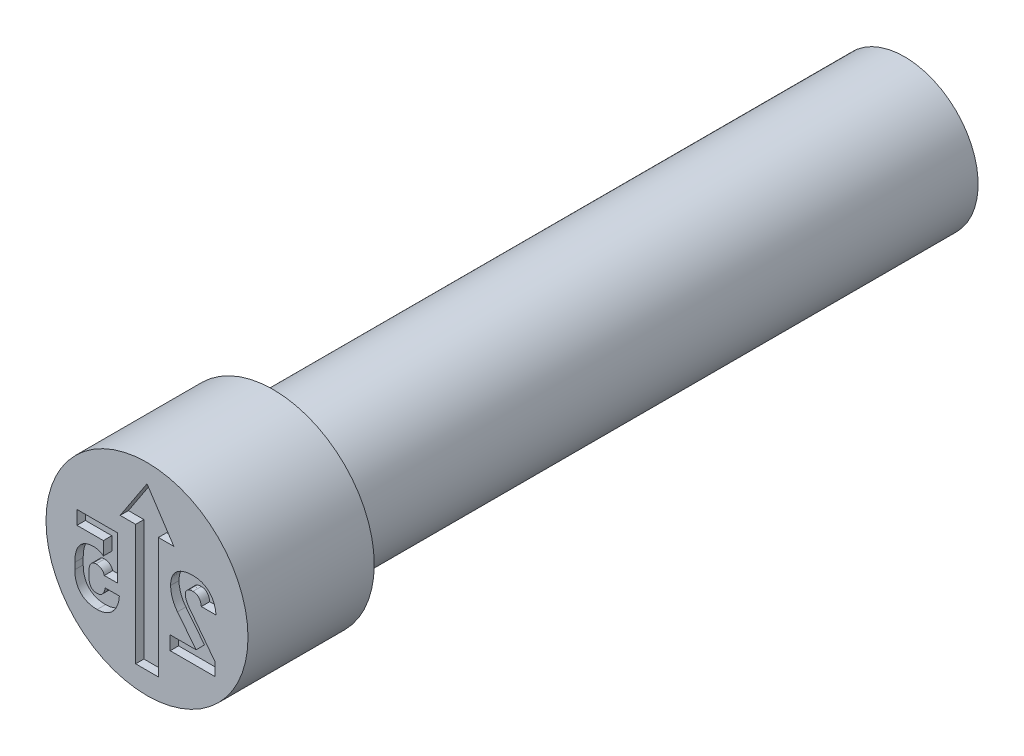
ISO-10303-21;
HEADER;
FILE_DESCRIPTION(('STEP AP214'),'2;1');
FILE_NAME('part.step','',(''),(''),'','','');
FILE_SCHEMA(('AUTOMOTIVE_DESIGN { 1 0 10303 214 1 1 1 1 }'));
ENDSEC;
DATA;
#1=APPLICATION_CONTEXT('core data for automotive mechanical design processes');
#2=APPLICATION_PROTOCOL_DEFINITION('international standard','automotive_design',2000,#1);
#3=PRODUCT_CONTEXT('',#1,'mechanical');
#4=PRODUCT('Part','Part','',(#3));
#5=PRODUCT_RELATED_PRODUCT_CATEGORY('part','',(#4));
#6=PRODUCT_DEFINITION_FORMATION('','',#4);
#7=PRODUCT_DEFINITION_CONTEXT('part definition',#1,'design');
#8=PRODUCT_DEFINITION('design','',#6,#7);
#9=PRODUCT_DEFINITION_SHAPE('','',#8);
#10=(LENGTH_UNIT() NAMED_UNIT(*) SI_UNIT(.MILLI.,.METRE.));
#11=(NAMED_UNIT(*) PLANE_ANGLE_UNIT() SI_UNIT($,.RADIAN.));
#12=(NAMED_UNIT(*) SI_UNIT($,.STERADIAN.) SOLID_ANGLE_UNIT());
#13=UNCERTAINTY_MEASURE_WITH_UNIT(LENGTH_MEASURE(1.E-05),#10,'distance_accuracy_value','');
#14=(GEOMETRIC_REPRESENTATION_CONTEXT(3) GLOBAL_UNCERTAINTY_ASSIGNED_CONTEXT((#13)) GLOBAL_UNIT_ASSIGNED_CONTEXT((#10,
#11,#12)) REPRESENTATION_CONTEXT('',''));
#15=CARTESIAN_POINT('',(0.,0.,0.));
#16=DIRECTION('',(0.,0.,1.));
#17=DIRECTION('',(1.,0.,0.));
#18=AXIS2_PLACEMENT_3D('',#15,#16,#17);
#19=CARTESIAN_POINT('',(-0.27,-1.88,-3.34769690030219));
#20=DIRECTION('',(-1.,0.,0.));
#21=DIRECTION('',(0.,0.,1.));
#22=AXIS2_PLACEMENT_3D('',#19,#20,#21);
#23=PLANE('',#22);
#24=DIRECTION('',(0.,-1.,0.));
#25=VECTOR('',#24,1.);
#26=CARTESIAN_POINT('',(-0.27,0.990629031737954,-0.19671914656));
#27=LINE('',#26,#25);
#28=CARTESIAN_POINT('',(-0.27,0.990629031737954,-0.19671914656));
#29=VERTEX_POINT('',#28);
#30=CARTESIAN_POINT('',(-0.27,-1.88,-0.19671914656));
#31=VERTEX_POINT('',#30);
#32=EDGE_CURVE('E532',#29,#31,#27,.T.);
#33=ORIENTED_EDGE('',*,*,#32,.F.);
#34=DIRECTION('',(0.,0.,1.));
#35=VECTOR('',#34,1.);
#36=CARTESIAN_POINT('',(-0.27,0.990629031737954,-0.21335957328));
#37=LINE('',#36,#35);
#38=CARTESIAN_POINT('',(-0.27,0.990629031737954,0.));
#39=VERTEX_POINT('',#38);
#40=EDGE_CURVE('E541',#39,#29,#37,.F.);
#41=ORIENTED_EDGE('',*,*,#40,.F.);
#42=DIRECTION('',(0.,1.,0.));
#43=VECTOR('',#42,1.);
#44=CARTESIAN_POINT('',(-0.27,0.,0.));
#45=LINE('',#44,#43);
#46=CARTESIAN_POINT('',(-0.27,-1.88,0.));
#47=VERTEX_POINT('',#46);
#48=EDGE_CURVE('E560',#47,#39,#45,.T.);
#49=ORIENTED_EDGE('',*,*,#48,.F.);
#50=DIRECTION('',(0.,0.,-1.));
#51=VECTOR('',#50,1.);
#52=CARTESIAN_POINT('',(-0.27,-1.88,-3.34769690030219));
#53=LINE('',#52,#51);
#54=EDGE_CURVE('E563',#47,#31,#53,.T.);
#55=ORIENTED_EDGE('',*,*,#54,.T.);
#56=EDGE_LOOP('',(#33,#41,#49,#55));
#57=FACE_BOUND('',#56,.T.);
#58=ADVANCED_FACE('F34',(#57),#23,.F.);
#59=CARTESIAN_POINT('',(3.694814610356E-13,0.990629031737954,-0.21335957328));
#60=DIRECTION('',(0.,1.,0.));
#61=DIRECTION('',(0.,0.,1.));
#62=AXIS2_PLACEMENT_3D('',#59,#60,#61);
#63=PLANE('',#62);
#64=ORIENTED_EDGE('',*,*,#40,.T.);
#65=DIRECTION('',(1.,0.,0.));
#66=VECTOR('',#65,1.);
#67=CARTESIAN_POINT('',(-0.638461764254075,0.990629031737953,-0.19671914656));
#68=LINE('',#67,#66);
#69=CARTESIAN_POINT('',(-0.63846176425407,0.990629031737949,-0.19671914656));
#70=VERTEX_POINT('',#69);
#71=EDGE_CURVE('E529',#70,#29,#68,.T.);
#72=ORIENTED_EDGE('',*,*,#71,.F.);
#73=DIRECTION('',(0.,0.,1.));
#74=VECTOR('',#73,1.);
#75=CARTESIAN_POINT('',(-0.63846176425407,0.990629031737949,-0.97535804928));
#76=LINE('',#75,#74);
#77=CARTESIAN_POINT('',(-0.638461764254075,0.990629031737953,0.));
#78=VERTEX_POINT('',#77);
#79=EDGE_CURVE('E575',#70,#78,#76,.T.);
#80=ORIENTED_EDGE('',*,*,#79,.T.);
#81=DIRECTION('',(1.,0.,0.));
#82=VECTOR('',#81,1.);
#83=CARTESIAN_POINT('',(1.1999976,0.990629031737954,0.));
#84=LINE('',#83,#82);
#85=EDGE_CURVE('E557',#39,#78,#84,.F.);
#86=ORIENTED_EDGE('',*,*,#85,.F.);
#87=EDGE_LOOP('',(#64,#72,#80,#86));
#88=FACE_BOUND('',#87,.T.);
#89=ADVANCED_FACE('F610',(#88),#63,.T.);
#90=CARTESIAN_POINT('',(-1.08287651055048,0.316073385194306,-0.97535804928));
#91=DIRECTION('',(-0.835059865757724,0.550159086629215,0.));
#92=DIRECTION('',(-0.550159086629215,-0.835059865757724,0.));
#93=AXIS2_PLACEMENT_3D('',#90,#91,#92);
#94=PLANE('',#93);
#95=DIRECTION('',(-0.550159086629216,-0.835059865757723,0.));
#96=VECTOR('',#95,1.);
#97=CARTESIAN_POINT('',(0.,1.95971926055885,-0.19671914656));
#98=LINE('',#97,#96);
#99=CARTESIAN_POINT('',(0.,1.95971926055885,-0.19671914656));
#100=VERTEX_POINT('',#99);
#101=EDGE_CURVE('E526',#100,#70,#98,.T.);
#102=ORIENTED_EDGE('',*,*,#101,.F.);
#103=DIRECTION('',(0.,0.,1.));
#104=VECTOR('',#103,1.);
#105=CARTESIAN_POINT('',(0.,1.95971926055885,-0.97535804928));
#106=LINE('',#105,#104);
#107=CARTESIAN_POINT('',(0.,1.95971926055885,0.));
#108=VERTEX_POINT('',#107);
#109=EDGE_CURVE('E573',#100,#108,#106,.T.);
#110=ORIENTED_EDGE('',*,*,#109,.T.);
#111=DIRECTION('',(0.550159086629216,0.835059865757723,0.));
#112=VECTOR('',#111,1.);
#113=CARTESIAN_POINT('',(-0.638461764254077,0.990629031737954,0.));
#114=LINE('',#113,#112);
#115=EDGE_CURVE('E554',#78,#108,#114,.T.);
#116=ORIENTED_EDGE('',*,*,#115,.F.);
#117=ORIENTED_EDGE('',*,*,#79,.F.);
#118=EDGE_LOOP('',(#102,#110,#116,#117));
#119=FACE_BOUND('',#118,.T.);
#120=ADVANCED_FACE('F614',(#119),#94,.F.);
#121=CARTESIAN_POINT('',(0.,1.95971926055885,-0.97535804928));
#122=DIRECTION('',(0.835059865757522,0.550159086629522,0.));
#123=DIRECTION('',(-0.550159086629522,0.835059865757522,0.));
#124=AXIS2_PLACEMENT_3D('',#121,#122,#123);
#125=PLANE('',#124);
#126=DIRECTION('',(-0.550159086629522,0.835059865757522,0.));
#127=VECTOR('',#126,1.);
#128=CARTESIAN_POINT('',(0.638461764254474,0.990629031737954,-0.19671914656));
#129=LINE('',#128,#127);
#130=CARTESIAN_POINT('',(0.638461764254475,0.990629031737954,-0.19671914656));
#131=VERTEX_POINT('',#130);
#132=EDGE_CURVE('E523',#131,#100,#129,.T.);
#133=ORIENTED_EDGE('',*,*,#132,.F.);
#134=DIRECTION('',(0.,0.,1.));
#135=VECTOR('',#134,1.);
#136=CARTESIAN_POINT('',(0.638461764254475,0.990629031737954,-0.21335957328));
#137=LINE('',#136,#135);
#138=CARTESIAN_POINT('',(0.638461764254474,0.990629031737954,0.));
#139=VERTEX_POINT('',#138);
#140=EDGE_CURVE('E570',#139,#131,#137,.F.);
#141=ORIENTED_EDGE('',*,*,#140,.F.);
#142=DIRECTION('',(0.550159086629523,-0.835059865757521,0.));
#143=VECTOR('',#142,1.);
#144=CARTESIAN_POINT('',(0.,1.95971926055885,0.));
#145=LINE('',#144,#143);
#146=EDGE_CURVE('E551',#108,#139,#145,.T.);
#147=ORIENTED_EDGE('',*,*,#146,.F.);
#148=ORIENTED_EDGE('',*,*,#109,.F.);
#149=EDGE_LOOP('',(#133,#141,#147,#148));
#150=FACE_BOUND('',#149,.T.);
#151=ADVANCED_FACE('F618',(#150),#125,.F.);
#152=CARTESIAN_POINT('',(3.694814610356E-13,0.990629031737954,-0.21335957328));
#153=DIRECTION('',(0.,1.,0.));
#154=DIRECTION('',(0.,0.,1.));
#155=AXIS2_PLACEMENT_3D('',#152,#153,#154);
#156=PLANE('',#155);
#157=ORIENTED_EDGE('',*,*,#140,.T.);
#158=DIRECTION('',(1.,0.,0.));
#159=VECTOR('',#158,1.);
#160=CARTESIAN_POINT('',(0.27,0.990629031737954,-0.19671914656));
#161=LINE('',#160,#159);
#162=CARTESIAN_POINT('',(0.27,0.990629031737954,-0.19671914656));
#163=VERTEX_POINT('',#162);
#164=EDGE_CURVE('E489',#163,#131,#161,.T.);
#165=ORIENTED_EDGE('',*,*,#164,.F.);
#166=DIRECTION('',(0.,0.,-1.));
#167=VECTOR('',#166,1.);
#168=CARTESIAN_POINT('',(0.27,0.990629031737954,-3.34769690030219));
#169=LINE('',#168,#167);
#170=CARTESIAN_POINT('',(0.27,0.990629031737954,0.));
#171=VERTEX_POINT('',#170);
#172=EDGE_CURVE('E568',#163,#171,#169,.F.);
#173=ORIENTED_EDGE('',*,*,#172,.T.);
#174=DIRECTION('',(1.,0.,0.));
#175=VECTOR('',#174,1.);
#176=CARTESIAN_POINT('',(1.1999976,0.990629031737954,0.));
#177=LINE('',#176,#175);
#178=EDGE_CURVE('E548',#139,#171,#177,.F.);
#179=ORIENTED_EDGE('',*,*,#178,.F.);
#180=EDGE_LOOP('',(#157,#165,#173,#179));
#181=FACE_BOUND('',#180,.T.);
#182=ADVANCED_FACE('F620',(#181),#156,.T.);
#183=CARTESIAN_POINT('',(0.27,-1.88,-3.34769690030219));
#184=DIRECTION('',(1.,0.,0.));
#185=DIRECTION('',(0.,0.,-1.));
#186=AXIS2_PLACEMENT_3D('',#183,#184,#185);
#187=PLANE('',#186);
#188=DIRECTION('',(0.,1.,0.));
#189=VECTOR('',#188,1.);
#190=CARTESIAN_POINT('',(0.27,-1.88,-0.19671914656));
#191=LINE('',#190,#189);
#192=CARTESIAN_POINT('',(0.27,-1.88,-0.19671914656));
#193=VERTEX_POINT('',#192);
#194=EDGE_CURVE('E538',#193,#163,#191,.T.);
#195=ORIENTED_EDGE('',*,*,#194,.F.);
#196=DIRECTION('',(0.,0.,-1.));
#197=VECTOR('',#196,1.);
#198=CARTESIAN_POINT('',(0.27,-1.88,-3.34769690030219));
#199=LINE('',#198,#197);
#200=CARTESIAN_POINT('',(0.27,-1.88,0.));
#201=VERTEX_POINT('',#200);
#202=EDGE_CURVE('E566',#193,#201,#199,.F.);
#203=ORIENTED_EDGE('',*,*,#202,.T.);
#204=DIRECTION('',(0.,1.,0.));
#205=VECTOR('',#204,1.);
#206=CARTESIAN_POINT('',(0.27,0.,0.));
#207=LINE('',#206,#205);
#208=EDGE_CURVE('E545',#171,#201,#207,.F.);
#209=ORIENTED_EDGE('',*,*,#208,.F.);
#210=ORIENTED_EDGE('',*,*,#172,.F.);
#211=EDGE_LOOP('',(#195,#203,#209,#210));
#212=FACE_BOUND('',#211,.T.);
#213=ADVANCED_FACE('F603',(#212),#187,.F.);
#214=CARTESIAN_POINT('',(-0.27,-1.88,-3.34769690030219));
#215=DIRECTION('',(0.,-1.,0.));
#216=DIRECTION('',(0.,0.,-1.));
#217=AXIS2_PLACEMENT_3D('',#214,#215,#216);
#218=PLANE('',#217);
#219=DIRECTION('',(1.,0.,0.));
#220=VECTOR('',#219,1.);
#221=CARTESIAN_POINT('',(-0.27,-1.88,-0.19671914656));
#222=LINE('',#221,#220);
#223=EDGE_CURVE('E535',#31,#193,#222,.T.);
#224=ORIENTED_EDGE('',*,*,#223,.F.);
#225=ORIENTED_EDGE('',*,*,#54,.F.);
#226=DIRECTION('',(1.,0.,0.));
#227=VECTOR('',#226,1.);
#228=CARTESIAN_POINT('',(1.1999976,-1.88,0.));
#229=LINE('',#228,#227);
#230=EDGE_CURVE('E542',#201,#47,#229,.F.);
#231=ORIENTED_EDGE('',*,*,#230,.F.);
#232=ORIENTED_EDGE('',*,*,#202,.F.);
#233=EDGE_LOOP('',(#224,#225,#231,#232));
#234=FACE_BOUND('',#233,.T.);
#235=ADVANCED_FACE('F593',(#234),#218,.F.);
#236=CARTESIAN_POINT('',(1.1999976,0.,0.));
#237=DIRECTION('',(0.,0.,1.));
#238=DIRECTION('',(1.,0.,0.));
#239=AXIS2_PLACEMENT_3D('',#236,#237,#238);
#240=PLANE('',#239);
#241=CARTESIAN_POINT('',(-1.7160362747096,-0.666272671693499,0.));
#242=CARTESIAN_POINT('',(-1.71523272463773,-0.694307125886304,0.));
#243=CARTESIAN_POINT('',(-1.71367823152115,-0.74854066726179,0.));
#244=CARTESIAN_POINT('',(-1.70256197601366,-0.826966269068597,0.));
#245=CARTESIAN_POINT('',(-1.68252251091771,-0.898905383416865,0.));
#246=CARTESIAN_POINT('',(-1.65567257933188,-0.96482310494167,0.));
#247=CARTESIAN_POINT('',(-1.62061216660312,-1.02340953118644,0.));
#248=CARTESIAN_POINT('',(-1.57862940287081,-1.07515956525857,0.));
#249=CARTESIAN_POINT('',(-1.52895814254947,-1.11887835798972,0.));
#250=CARTESIAN_POINT('',(-1.47277065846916,-1.15567141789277,0.));
#251=CARTESIAN_POINT('',(-1.40953232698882,-1.1838891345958,0.));
#252=CARTESIAN_POINT('',(-1.34025369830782,-1.20438838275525,0.));
#253=CARTESIAN_POINT('',(-1.26466061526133,-1.21658143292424,0.));
#254=CARTESIAN_POINT('',(-1.21231212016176,-1.21798315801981,0.));
#255=CARTESIAN_POINT('',(-1.18524352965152,-1.21870796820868,0.));
#256=B_SPLINE_CURVE_WITH_KNOTS('',3,(#241,#242,#243,#244,#245,#246,#247,#248,#249,#250,#251,
#252,#253,#254,#255),.UNSPECIFIED.,.F.,.F.,(4,1,1,1,1,1,1,1,1,1,1,1,4),(0.,0.0965919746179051,
0.1868602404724,0.272108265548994,0.353324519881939,0.431359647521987,0.506505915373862,
0.582010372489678,0.6584354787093,0.737063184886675,0.819709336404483,0.906774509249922,1.),.UNSPECIFIED.);
#257=CARTESIAN_POINT('',(-1.7160362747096,-0.666272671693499,0.));
#258=VERTEX_POINT('',#257);
#259=CARTESIAN_POINT('',(-1.18524352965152,-1.21870796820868,0.));
#260=VERTEX_POINT('',#259);
#261=EDGE_CURVE('E50',#258,#260,#256,.T.);
#262=ORIENTED_EDGE('',*,*,#261,.F.);
#263=DIRECTION('',(0.,-1.,0.));
#264=VECTOR('',#263,1.);
#265=CARTESIAN_POINT('',(-1.7160362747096,-0.515508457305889,0.));
#266=LINE('',#265,#264);
#267=CARTESIAN_POINT('',(-1.7160362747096,-0.515508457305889,0.));
#268=VERTEX_POINT('',#267);
#269=EDGE_CURVE('E331',#268,#258,#266,.T.);
#270=ORIENTED_EDGE('',*,*,#269,.F.);
#271=CARTESIAN_POINT('',(-1.27291420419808,0.0354595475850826,0.));
#272=CARTESIAN_POINT('',(-1.29547328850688,0.0347453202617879,0.));
#273=CARTESIAN_POINT('',(-1.33922622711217,0.0333600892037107,0.));
#274=CARTESIAN_POINT('',(-1.40233627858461,0.0208996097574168,0.));
#275=CARTESIAN_POINT('',(-1.46049805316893,0.000936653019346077,0.));
#276=CARTESIAN_POINT('',(-1.51323162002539,-0.0278241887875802,0.));
#277=CARTESIAN_POINT('',(-1.56059662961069,-0.063871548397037,0.));
#278=CARTESIAN_POINT('',(-1.60173671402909,-0.107918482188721,0.));
#279=CARTESIAN_POINT('',(-1.63690833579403,-0.159247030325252,0.));
#280=CARTESIAN_POINT('',(-1.6656932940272,-0.217891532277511,0.));
#281=CARTESIAN_POINT('',(-1.68834826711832,-0.283338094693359,0.));
#282=CARTESIAN_POINT('',(-1.70480325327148,-0.355129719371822,0.));
#283=CARTESIAN_POINT('',(-1.71418057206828,-0.433336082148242,0.));
#284=CARTESIAN_POINT('',(-1.71540335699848,-0.487482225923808,0.));
#285=CARTESIAN_POINT('',(-1.7160362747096,-0.515508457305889,0.));
#286=B_SPLINE_CURVE_WITH_KNOTS('',3,(#271,#272,#273,#274,#275,#276,#277,#278,#279,#280,#281,
#282,#283,#284,#285),.UNSPECIFIED.,.F.,.F.,(4,1,1,1,1,1,1,1,1,1,1,1,4),(0.,0.0843949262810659,
0.163682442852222,0.239848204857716,0.313806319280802,0.3876154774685,0.461788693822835,
0.538496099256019,0.61978489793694,0.70565234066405,0.797279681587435,0.895071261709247,1.),.UNSPECIFIED.);
#287=CARTESIAN_POINT('',(-1.27291420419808,0.0354595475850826,0.));
#288=VERTEX_POINT('',#287);
#289=EDGE_CURVE('E334',#288,#268,#286,.T.);
#290=ORIENTED_EDGE('',*,*,#289,.F.);
#291=CARTESIAN_POINT('',(-1.03668025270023,-0.0448746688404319,0.));
#292=CARTESIAN_POINT('',(-1.04350946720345,-0.0388275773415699,0.));
#293=CARTESIAN_POINT('',(-1.05755769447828,-0.0263882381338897,0.));
#294=CARTESIAN_POINT('',(-1.08211803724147,-0.0105937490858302,0.));
#295=CARTESIAN_POINT('',(-1.11020753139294,0.00282108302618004,0.));
#296=CARTESIAN_POINT('',(-1.15165618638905,0.0182713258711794,0.));
#297=CARTESIAN_POINT('',(-1.20618010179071,0.0320103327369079,0.));
#298=CARTESIAN_POINT('',(-1.25094041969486,0.0343238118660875,0.));
#299=CARTESIAN_POINT('',(-1.27291420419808,0.0354595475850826,0.));
#300=B_SPLINE_CURVE_WITH_KNOTS('',3,(#291,#292,#293,#294,#295,#296,#297,#298,#299),
.UNSPECIFIED.,.F.,.F.,(4,1,1,1,1,1,4),(0.,0.107291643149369,0.220707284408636,0.342410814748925,
0.473179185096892,0.74137254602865,1.),.UNSPECIFIED.);
#301=CARTESIAN_POINT('',(-1.03668025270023,-0.0448746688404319,0.));
#302=VERTEX_POINT('',#301);
#303=EDGE_CURVE('E1120',#302,#288,#300,.T.);
#304=ORIENTED_EDGE('',*,*,#303,.F.);
#305=DIRECTION('',(0.,-1.,0.));
#306=VECTOR('',#305,1.);
#307=CARTESIAN_POINT('',(-1.03668025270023,0.273160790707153,0.));
#308=LINE('',#307,#306);
#309=CARTESIAN_POINT('',(-1.03668025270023,0.273160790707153,0.));
#310=VERTEX_POINT('',#309);
#311=EDGE_CURVE('E1117',#310,#302,#308,.T.);
#312=ORIENTED_EDGE('',*,*,#311,.F.);
#313=DIRECTION('',(1.,0.,0.));
#314=VECTOR('',#313,1.);
#315=CARTESIAN_POINT('',(-1.66431424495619,0.273160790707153,0.));
#316=LINE('',#315,#314);
#317=CARTESIAN_POINT('',(-1.66431424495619,0.273160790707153,0.));
#318=VERTEX_POINT('',#317);
#319=EDGE_CURVE('E1114',#318,#310,#316,.T.);
#320=ORIENTED_EDGE('',*,*,#319,.F.);
#321=DIRECTION('',(0.,-1.,0.));
#322=VECTOR('',#321,1.);
#323=CARTESIAN_POINT('',(-1.66431424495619,0.6,0.));
#324=LINE('',#323,#322);
#325=CARTESIAN_POINT('',(-1.66431424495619,0.6,0.));
#326=VERTEX_POINT('',#325);
#327=EDGE_CURVE('E1111',#326,#318,#324,.T.);
#328=ORIENTED_EDGE('',*,*,#327,.F.);
#329=DIRECTION('',(-1.,0.,0.));
#330=VECTOR('',#329,1.);
#331=CARTESIAN_POINT('',(-0.69736906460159,0.6,0.));
#332=LINE('',#331,#330);
#333=CARTESIAN_POINT('',(-0.69736906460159,0.6,0.));
#334=VERTEX_POINT('',#333);
#335=EDGE_CURVE('E1108',#334,#326,#332,.T.);
#336=ORIENTED_EDGE('',*,*,#335,.F.);
#337=DIRECTION('',(0.,1.,0.));
#338=VECTOR('',#337,1.);
#339=CARTESIAN_POINT('',(-0.69736906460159,-0.434807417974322,0.));
#340=LINE('',#339,#338);
#341=CARTESIAN_POINT('',(-0.69736906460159,-0.434807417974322,0.));
#342=VERTEX_POINT('',#341);
#343=EDGE_CURVE('E1105',#342,#334,#340,.T.);
#344=ORIENTED_EDGE('',*,*,#343,.F.);
#345=DIRECTION('',(1.,0.,0.));
#346=VECTOR('',#345,1.);
#347=CARTESIAN_POINT('',(-1.01430405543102,-0.434807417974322,0.));
#348=LINE('',#347,#346);
#349=CARTESIAN_POINT('',(-1.01430405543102,-0.434807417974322,0.));
#350=VERTEX_POINT('',#349);
#351=EDGE_CURVE('E1099',#350,#342,#348,.T.);
#352=ORIENTED_EDGE('',*,*,#351,.F.);
#353=CARTESIAN_POINT('',(-1.20982066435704,-0.29358059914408,0.));
#354=CARTESIAN_POINT('',(-1.19804385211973,-0.293939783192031,0.));
#355=CARTESIAN_POINT('',(-1.17524437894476,-0.294635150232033,0.));
#356=CARTESIAN_POINT('',(-1.14241670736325,-0.301835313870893,0.));
#357=CARTESIAN_POINT('',(-1.11224483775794,-0.313615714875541,0.));
#358=CARTESIAN_POINT('',(-1.08507127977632,-0.330271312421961,0.));
#359=CARTESIAN_POINT('',(-1.06107109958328,-0.350684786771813,0.));
#360=CARTESIAN_POINT('',(-1.04131142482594,-0.37535080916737,0.));
#361=CARTESIAN_POINT('',(-1.02474717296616,-0.403222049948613,0.));
#362=CARTESIAN_POINT('',(-1.01783567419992,-0.424125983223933,0.));
#363=CARTESIAN_POINT('',(-1.01430405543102,-0.434807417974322,0.));
#364=B_SPLINE_CURVE_WITH_KNOTS('',3,(#353,#354,#355,#356,#357,#358,#359,#360,#361,#362,#363),
.UNSPECIFIED.,.F.,.F.,(4,1,1,1,1,1,1,1,4),(0.,0.135635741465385,0.262585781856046,
0.385395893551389,0.507524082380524,0.628507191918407,0.746772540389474,0.870606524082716,1.),.UNSPECIFIED.);
#365=CARTESIAN_POINT('',(-1.20982066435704,-0.29358059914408,0.));
#366=VERTEX_POINT('',#365);
#367=EDGE_CURVE('E1091',#366,#350,#364,.T.);
#368=ORIENTED_EDGE('',*,*,#367,.F.);
#369=CARTESIAN_POINT('',(-1.37709190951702,-0.515508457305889,0.));
#370=CARTESIAN_POINT('',(-1.37672963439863,-0.498712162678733,0.));
#371=CARTESIAN_POINT('',(-1.37604208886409,-0.466835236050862,0.));
#372=CARTESIAN_POINT('',(-1.36748904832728,-0.422244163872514,0.));
#373=CARTESIAN_POINT('',(-1.35419076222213,-0.383339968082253,0.));
#374=CARTESIAN_POINT('',(-1.33455104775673,-0.351044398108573,0.));
#375=CARTESIAN_POINT('',(-1.31013686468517,-0.324976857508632,0.));
#376=CARTESIAN_POINT('',(-1.28059268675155,-0.306462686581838,0.));
#377=CARTESIAN_POINT('',(-1.24651191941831,-0.295527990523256,0.));
#378=CARTESIAN_POINT('',(-1.22237496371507,-0.294246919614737,0.));
#379=CARTESIAN_POINT('',(-1.20982066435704,-0.29358059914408,0.));
#380=B_SPLINE_CURVE_WITH_KNOTS('',3,(#369,#370,#371,#372,#373,#374,#375,#376,#377,#378,#379),
.UNSPECIFIED.,.F.,.F.,(4,1,1,1,1,1,1,1,4),(0.,0.160198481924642,0.304033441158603,
0.431843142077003,0.550810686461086,0.662316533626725,0.76988812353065,0.880312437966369,1.),.UNSPECIFIED.);
#381=CARTESIAN_POINT('',(-1.37709190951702,-0.515508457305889,0.));
#382=VERTEX_POINT('',#381);
#383=EDGE_CURVE('E1086',#382,#366,#380,.T.);
#384=ORIENTED_EDGE('',*,*,#383,.F.);
#385=DIRECTION('',(0.,1.,0.));
#386=VECTOR('',#385,1.);
#387=CARTESIAN_POINT('',(-1.37709190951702,-0.666272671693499,0.));
#388=LINE('',#387,#386);
#389=CARTESIAN_POINT('',(-1.37709190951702,-0.666272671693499,0.));
#390=VERTEX_POINT('',#389);
#391=EDGE_CURVE('E1080',#390,#382,#388,.T.);
#392=ORIENTED_EDGE('',*,*,#391,.F.);
#393=CARTESIAN_POINT('',(-1.1900122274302,-0.889300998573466,0.));
#394=CARTESIAN_POINT('',(-1.20415961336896,-0.888684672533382,0.));
#395=CARTESIAN_POINT('',(-1.23121989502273,-0.887505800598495,0.));
#396=CARTESIAN_POINT('',(-1.26914935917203,-0.876127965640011,0.));
#397=CARTESIAN_POINT('',(-1.30216839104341,-0.857911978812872,0.));
#398=CARTESIAN_POINT('',(-1.32944216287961,-0.831700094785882,0.));
#399=CARTESIAN_POINT('',(-1.35119968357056,-0.799040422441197,0.));
#400=CARTESIAN_POINT('',(-1.36660090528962,-0.759930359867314,0.));
#401=CARTESIAN_POINT('',(-1.37572199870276,-0.714990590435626,0.));
#402=CARTESIAN_POINT('',(-1.37661958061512,-0.683070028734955,0.));
#403=CARTESIAN_POINT('',(-1.37709190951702,-0.666272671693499,0.));
#404=B_SPLINE_CURVE_WITH_KNOTS('',3,(#393,#394,#395,#396,#397,#398,#399,#400,#401,#402,#403),
.UNSPECIFIED.,.F.,.F.,(4,1,1,1,1,1,1,1,4),(0.,0.128261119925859,0.245330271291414,
0.356275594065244,0.467886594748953,0.585607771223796,0.710231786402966,0.847517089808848,1.),.UNSPECIFIED.);
#405=CARTESIAN_POINT('',(-1.1900122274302,-0.889300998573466,0.));
#406=VERTEX_POINT('',#405);
#407=EDGE_CURVE('E1072',#406,#390,#404,.T.);
#408=ORIENTED_EDGE('',*,*,#407,.F.);
#409=CARTESIAN_POINT('',(-0.997063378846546,-0.679845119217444,0.));
#410=CARTESIAN_POINT('',(-0.999000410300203,-0.695599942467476,0.));
#411=CARTESIAN_POINT('',(-1.00269188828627,-0.725624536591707,0.));
#412=CARTESIAN_POINT('',(-1.01600337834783,-0.767290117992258,0.));
#413=CARTESIAN_POINT('',(-1.03338238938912,-0.803913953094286,0.));
#414=CARTESIAN_POINT('',(-1.05633869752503,-0.834644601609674,0.));
#415=CARTESIAN_POINT('',(-1.08359942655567,-0.859593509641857,0.));
#416=CARTESIAN_POINT('',(-1.11590248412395,-0.876514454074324,0.));
#417=CARTESIAN_POINT('',(-1.15160390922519,-0.887805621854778,0.));
#418=CARTESIAN_POINT('',(-1.17696011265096,-0.888792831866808,0.));
#419=CARTESIAN_POINT('',(-1.1900122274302,-0.889300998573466,0.));
#420=B_SPLINE_CURVE_WITH_KNOTS('',3,(#409,#410,#411,#412,#413,#414,#415,#416,#417,#418,#419),
.UNSPECIFIED.,.F.,.F.,(4,1,1,1,1,1,1,1,4),(0.,0.150277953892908,0.286390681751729,
0.412971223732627,0.533144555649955,0.648163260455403,0.760273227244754,0.876600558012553,1.),.UNSPECIFIED.);
#421=CARTESIAN_POINT('',(-0.997063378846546,-0.679845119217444,0.));
#422=VERTEX_POINT('',#421);
#423=EDGE_CURVE('E1067',#422,#406,#420,.T.);
#424=ORIENTED_EDGE('',*,*,#423,.F.);
#425=DIRECTION('',(0.,-1.,0.));
#426=VECTOR('',#425,1.);
#427=CARTESIAN_POINT('',(-0.997063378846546,-0.678744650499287,0.));
#428=LINE('',#427,#426);
#429=CARTESIAN_POINT('',(-0.997063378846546,-0.678744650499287,0.));
#430=VERTEX_POINT('',#429);
#431=EDGE_CURVE('E1064',#430,#422,#428,.T.);
#432=ORIENTED_EDGE('',*,*,#431,.F.);
#433=DIRECTION('',(-1.,0.,0.));
#434=VECTOR('',#433,1.);
#435=CARTESIAN_POINT('',(-0.657752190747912,-0.678744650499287,0.));
#436=LINE('',#435,#434);
#437=CARTESIAN_POINT('',(-0.657752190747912,-0.678744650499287,0.));
#438=VERTEX_POINT('',#437);
#439=EDGE_CURVE('E1061',#438,#430,#436,.T.);
#440=ORIENTED_EDGE('',*,*,#439,.F.);
#441=DIRECTION('',(0.,1.,0.));
#442=VECTOR('',#441,1.);
#443=CARTESIAN_POINT('',(-0.657752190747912,-0.679845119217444,0.));
#444=LINE('',#443,#442);
#445=CARTESIAN_POINT('',(-0.657752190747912,-0.679845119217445,0.));
#446=VERTEX_POINT('',#445);
#447=EDGE_CURVE('E1055',#446,#438,#444,.T.);
#448=ORIENTED_EDGE('',*,*,#447,.F.);
#449=CARTESIAN_POINT('',(-1.18524352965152,-1.21870796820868,0.));
#450=CARTESIAN_POINT('',(-1.16158614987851,-1.21798621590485,0.));
#451=CARTESIAN_POINT('',(-1.11529271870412,-1.21657387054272,0.));
#452=CARTESIAN_POINT('',(-1.04781335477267,-1.20389490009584,0.));
#453=CARTESIAN_POINT('',(-0.983840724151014,-1.18425921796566,0.));
#454=CARTESIAN_POINT('',(-0.923850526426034,-1.1562475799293,0.));
#455=CARTESIAN_POINT('',(-0.868494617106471,-1.12065962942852,0.));
#456=CARTESIAN_POINT('',(-0.818996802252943,-1.07714169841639,0.));
#457=CARTESIAN_POINT('',(-0.774903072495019,-1.02683316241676,0.));
#458=CARTESIAN_POINT('',(-0.737097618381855,-0.969293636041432,0.));
#459=CARTESIAN_POINT('',(-0.705963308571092,-0.905138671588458,0.));
#460=CARTESIAN_POINT('',(-0.681724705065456,-0.835124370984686,0.));
#461=CARTESIAN_POINT('',(-0.665076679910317,-0.759376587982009,0.));
#462=CARTESIAN_POINT('',(-0.660236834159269,-0.70682411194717,0.));
#463=CARTESIAN_POINT('',(-0.657752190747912,-0.679845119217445,0.));
#464=B_SPLINE_CURVE_WITH_KNOTS('',3,(#449,#450,#451,#452,#453,#454,#455,#456,#457,#458,#459,
#460,#461,#462,#463),.UNSPECIFIED.,.F.,.F.,(4,1,1,1,1,1,1,1,1,1,1,1,4),(0.,0.0844304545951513,
0.165215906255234,0.244369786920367,0.322918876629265,0.400936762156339,0.47863123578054,
0.557558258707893,0.639203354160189,0.723781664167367,0.811629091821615,0.903295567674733,1.),.UNSPECIFIED.);
#465=EDGE_CURVE('E1048',#260,#446,#464,.T.);
#466=ORIENTED_EDGE('',*,*,#465,.F.);
#467=EDGE_LOOP('',(#262,#270,#290,#304,#312,#320,#328,#336,#344,#352,#368,#384,#392,#408,#424,
#432,#440,#448,#466));
#468=FACE_BOUND('',#467,.T.);
#469=DIRECTION('',(0.,1.,0.));
#470=VECTOR('',#469,1.);
#471=CARTESIAN_POINT('',(1.61610963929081,-1.2,0.));
#472=LINE('',#471,#470);
#473=CARTESIAN_POINT('',(1.61610963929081,-1.2,0.));
#474=VERTEX_POINT('',#473);
#475=CARTESIAN_POINT('',(1.61610963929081,-0.89406969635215,0.));
#476=VERTEX_POINT('',#475);
#477=EDGE_CURVE('E58',#474,#476,#472,.T.);
#478=ORIENTED_EDGE('',*,*,#477,.F.);
#479=DIRECTION('',(1.,0.,0.));
#480=VECTOR('',#479,1.);
#481=CARTESIAN_POINT('',(0.551589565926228,-1.2,0.));
#482=LINE('',#481,#480);
#483=CARTESIAN_POINT('',(0.551589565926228,-1.2,0.));
#484=VERTEX_POINT('',#483);
#485=EDGE_CURVE('E483',#484,#474,#482,.T.);
#486=ORIENTED_EDGE('',*,*,#485,.F.);
#487=DIRECTION('',(0.,-1.,0.));
#488=VECTOR('',#487,1.);
#489=CARTESIAN_POINT('',(0.551589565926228,-0.873160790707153,0.));
#490=LINE('',#489,#488);
#491=CARTESIAN_POINT('',(0.551589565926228,-0.873160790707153,0.));
#492=VERTEX_POINT('',#491);
#493=EDGE_CURVE('E480',#492,#484,#490,.T.);
#494=ORIENTED_EDGE('',*,*,#493,.F.);
#495=DIRECTION('',(-1.,0.,0.));
#496=VECTOR('',#495,1.);
#497=CARTESIAN_POINT('',(1.1667515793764,-0.873160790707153,0.));
#498=LINE('',#497,#496);
#499=CARTESIAN_POINT('',(1.1667515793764,-0.873160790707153,0.));
#500=VERTEX_POINT('',#499);
#501=EDGE_CURVE('E477',#500,#492,#498,.T.);
#502=ORIENTED_EDGE('',*,*,#501,.F.);
#503=DIRECTION('',(0.620676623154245,-0.78406666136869,0.));
#504=VECTOR('',#503,1.);
#505=CARTESIAN_POINT('',(0.723629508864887,-0.313389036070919,0.));
#506=LINE('',#505,#504);
#507=CARTESIAN_POINT('',(0.723629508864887,-0.313389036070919,0.));
#508=VERTEX_POINT('',#507);
#509=EDGE_CURVE('E471',#508,#500,#506,.T.);
#510=ORIENTED_EDGE('',*,*,#509,.F.);
#511=CARTESIAN_POINT('',(0.561493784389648,0.148074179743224,0.));
#512=CARTESIAN_POINT('',(0.561964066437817,0.127628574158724,0.));
#513=CARTESIAN_POINT('',(0.562905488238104,0.0867000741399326,0.));
#514=CARTESIAN_POINT('',(0.571301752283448,0.0255541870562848,0.));
#515=CARTESIAN_POINT('',(0.585030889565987,-0.035238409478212,0.));
#516=CARTESIAN_POINT('',(0.60365948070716,-0.0954646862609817,0.));
#517=CARTESIAN_POINT('',(0.626921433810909,-0.154118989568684,0.));
#518=CARTESIAN_POINT('',(0.654682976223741,-0.210266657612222,0.));
#519=CARTESIAN_POINT('',(0.686378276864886,-0.263764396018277,0.));
#520=CARTESIAN_POINT('',(0.711214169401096,-0.296849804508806,0.));
#521=CARTESIAN_POINT('',(0.723629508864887,-0.313389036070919,0.));
#522=B_SPLINE_CURVE_WITH_KNOTS('',3,(#511,#512,#513,#514,#515,#516,#517,#518,#519,#520,#521),
.UNSPECIFIED.,.F.,.F.,(4,1,1,1,1,1,1,1,4),(0.,0.123148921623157,0.246522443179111,
0.371108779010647,0.498350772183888,0.625999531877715,0.750879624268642,0.875465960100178,1.),.UNSPECIFIED.);
#523=CARTESIAN_POINT('',(0.561493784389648,0.148074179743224,0.));
#524=VERTEX_POINT('',#523);
#525=EDGE_CURVE('E466',#524,#508,#522,.T.);
#526=ORIENTED_EDGE('',*,*,#525,.F.);
#527=DIRECTION('',(0.,-1.,0.));
#528=VECTOR('',#527,1.);
#529=CARTESIAN_POINT('',(0.561493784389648,0.149541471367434,0.));
#530=LINE('',#529,#528);
#531=CARTESIAN_POINT('',(0.561493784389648,0.149541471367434,0.));
#532=VERTEX_POINT('',#531);
#533=EDGE_CURVE('E460',#532,#524,#530,.T.);
#534=ORIENTED_EDGE('',*,*,#533,.F.);
#535=CARTESIAN_POINT('',(1.09375382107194,0.618707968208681,0.));
#536=CARTESIAN_POINT('',(1.06669752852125,0.618142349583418,0.));
#537=CARTESIAN_POINT('',(1.01433172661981,0.617047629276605,0.));
#538=CARTESIAN_POINT('',(0.938928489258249,0.60674208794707,0.));
#539=CARTESIAN_POINT('',(0.869593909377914,0.589592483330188,0.));
#540=CARTESIAN_POINT('',(0.806501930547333,0.565497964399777,0.));
#541=CARTESIAN_POINT('',(0.750066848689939,0.53452504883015,0.));
#542=CARTESIAN_POINT('',(0.700027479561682,0.497760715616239,0.));
#543=CARTESIAN_POINT('',(0.657796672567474,0.453777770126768,0.));
#544=CARTESIAN_POINT('',(0.622668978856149,0.403812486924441,0.));
#545=CARTESIAN_POINT('',(0.594977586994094,0.348057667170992,0.));
#546=CARTESIAN_POINT('',(0.575585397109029,0.286561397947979,0.));
#547=CARTESIAN_POINT('',(0.563709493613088,0.219817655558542,0.));
#548=CARTESIAN_POINT('',(0.562247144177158,0.173435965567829,0.));
#549=CARTESIAN_POINT('',(0.561493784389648,0.149541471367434,0.));
#550=B_SPLINE_CURVE_WITH_KNOTS('',3,(#535,#536,#537,#538,#539,#540,#541,#542,#543,#544,#545,
#546,#547,#548,#549),.UNSPECIFIED.,.F.,.F.,(4,1,1,1,1,1,1,1,1,1,1,1,4),(0.,0.100715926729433,
0.194929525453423,0.2827284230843,0.366191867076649,0.44566981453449,0.521804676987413,
0.596515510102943,0.671682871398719,0.748455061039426,0.827368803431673,0.911065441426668,1.),.UNSPECIFIED.);
#551=CARTESIAN_POINT('',(1.09375382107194,0.618707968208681,0.));
#552=VERTEX_POINT('',#551);
#553=EDGE_CURVE('E452',#552,#532,#550,.T.);
#554=ORIENTED_EDGE('',*,*,#553,.F.);
#555=CARTESIAN_POINT('',(1.63848583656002,0.080211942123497,0.));
#556=CARTESIAN_POINT('',(1.63599418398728,0.107310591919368,0.));
#557=CARTESIAN_POINT('',(1.63114029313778,0.16010041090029,0.));
#558=CARTESIAN_POINT('',(1.61463569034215,0.236016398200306,0.));
#559=CARTESIAN_POINT('',(1.59025360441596,0.305870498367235,0.));
#560=CARTESIAN_POINT('',(1.55910210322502,0.369855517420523,0.));
#561=CARTESIAN_POINT('',(1.52090493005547,0.427163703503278,0.));
#562=CARTESIAN_POINT('',(1.47658484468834,0.477779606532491,0.));
#563=CARTESIAN_POINT('',(1.42565097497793,0.520720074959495,0.));
#564=CARTESIAN_POINT('',(1.36898556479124,0.556401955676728,0.));
#565=CARTESIAN_POINT('',(1.30683611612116,0.58432664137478,0.));
#566=CARTESIAN_POINT('',(1.23996268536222,0.604672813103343,0.));
#567=CARTESIAN_POINT('',(1.16826455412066,0.616402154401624,0.));
#568=CARTESIAN_POINT('',(1.11898505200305,0.617927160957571,0.));
#569=CARTESIAN_POINT('',(1.09375382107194,0.618707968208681,0.));
#570=B_SPLINE_CURVE_WITH_KNOTS('',3,(#555,#556,#557,#558,#559,#560,#561,#562,#563,#564,#565,
#566,#567,#568,#569),.UNSPECIFIED.,.F.,.F.,(4,1,1,1,1,1,1,1,1,1,1,1,4),(0.,0.0953291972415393,
0.185707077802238,0.271513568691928,0.35413169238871,0.434493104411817,0.512233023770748,
0.58917600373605,0.667186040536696,0.746219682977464,0.827302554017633,0.911578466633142,1.),.UNSPECIFIED.);
#571=CARTESIAN_POINT('',(1.63848583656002,0.080211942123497,0.));
#572=VERTEX_POINT('',#571);
#573=EDGE_CURVE('E447',#572,#552,#570,.T.);
#574=ORIENTED_EDGE('',*,*,#573,.F.);
#575=DIRECTION('',(0.,1.,0.));
#576=VECTOR('',#575,1.);
#577=CARTESIAN_POINT('',(1.63848583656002,0.0787446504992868,0.));
#578=LINE('',#577,#576);
#579=CARTESIAN_POINT('',(1.63848583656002,0.0787446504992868,0.));
#580=VERTEX_POINT('',#579);
#581=EDGE_CURVE('E444',#580,#572,#578,.T.);
#582=ORIENTED_EDGE('',*,*,#581,.F.);
#583=DIRECTION('',(1.,0.,0.));
#584=VECTOR('',#583,1.);
#585=CARTESIAN_POINT('',(1.29073772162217,0.0787446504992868,0.));
#586=LINE('',#585,#584);
#587=CARTESIAN_POINT('',(1.29073772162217,0.0787446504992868,0.));
#588=VERTEX_POINT('',#587);
#589=EDGE_CURVE('E441',#588,#580,#586,.T.);
#590=ORIENTED_EDGE('',*,*,#589,.F.);
#591=DIRECTION('',(0.,-1.,0.));
#592=VECTOR('',#591,1.);
#593=CARTESIAN_POINT('',(1.29073772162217,0.080211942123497,0.));
#594=LINE('',#593,#592);
#595=CARTESIAN_POINT('',(1.29073772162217,0.080211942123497,0.));
#596=VERTEX_POINT('',#595);
#597=EDGE_CURVE('E435',#596,#588,#594,.T.);
#598=ORIENTED_EDGE('',*,*,#597,.F.);
#599=CARTESIAN_POINT('',(1.09118606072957,0.291868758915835,0.));
#600=CARTESIAN_POINT('',(1.10458202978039,0.291302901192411,0.));
#601=CARTESIAN_POINT('',(1.13057936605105,0.290204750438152,0.));
#602=CARTESIAN_POINT('',(1.16756076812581,0.279740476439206,0.));
#603=CARTESIAN_POINT('',(1.20041260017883,0.261975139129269,0.));
#604=CARTESIAN_POINT('',(1.22885117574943,0.237423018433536,0.));
#605=CARTESIAN_POINT('',(1.25271371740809,0.206536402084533,0.));
#606=CARTESIAN_POINT('',(1.27030218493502,0.169328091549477,0.));
#607=CARTESIAN_POINT('',(1.28446646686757,0.127039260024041,0.));
#608=CARTESIAN_POINT('',(1.28857691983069,0.0963466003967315,0.));
#609=CARTESIAN_POINT('',(1.29073772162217,0.080211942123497,0.));
#610=B_SPLINE_CURVE_WITH_KNOTS('',3,(#599,#600,#601,#602,#603,#604,#605,#606,#607,#608,#609),
.UNSPECIFIED.,.F.,.F.,(4,1,1,1,1,1,1,1,4),(0.,0.124212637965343,0.241057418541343,
0.353359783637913,0.468536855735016,0.587568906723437,0.713021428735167,0.849139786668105,1.),.UNSPECIFIED.);
#611=CARTESIAN_POINT('',(1.09118606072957,0.291868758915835,0.));
#612=VERTEX_POINT('',#611);
#613=EDGE_CURVE('E427',#612,#596,#610,.T.);
#614=ORIENTED_EDGE('',*,*,#613,.F.);
#615=CARTESIAN_POINT('',(0.910709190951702,0.139637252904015,0.));
#616=CARTESIAN_POINT('',(0.911201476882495,0.151195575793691,0.));
#617=CARTESIAN_POINT('',(0.912139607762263,0.173221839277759,0.));
#618=CARTESIAN_POINT('',(0.921196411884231,0.204210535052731,0.));
#619=CARTESIAN_POINT('',(0.936172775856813,0.231007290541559,0.));
#620=CARTESIAN_POINT('',(0.957150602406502,0.253470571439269,0.));
#621=CARTESIAN_POINT('',(0.983834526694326,0.270734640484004,0.));
#622=CARTESIAN_POINT('',(1.01530990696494,0.283345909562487,0.));
#623=CARTESIAN_POINT('',(1.05174400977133,0.290481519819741,0.));
#624=CARTESIAN_POINT('',(1.07758204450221,0.291390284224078,0.));
#625=CARTESIAN_POINT('',(1.09118606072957,0.291868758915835,0.));
#626=B_SPLINE_CURVE_WITH_KNOTS('',3,(#615,#616,#617,#618,#619,#620,#621,#622,#623,#624,#625),
.UNSPECIFIED.,.F.,.F.,(4,1,1,1,1,1,1,1,4),(0.,0.129170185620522,0.246154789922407,
0.357734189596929,0.470108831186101,0.586692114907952,0.710769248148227,0.847716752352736,1.),.UNSPECIFIED.);
#627=CARTESIAN_POINT('',(0.910709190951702,0.139637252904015,0.));
#628=VERTEX_POINT('',#627);
#629=EDGE_CURVE('E422',#628,#612,#626,.T.);
#630=ORIENTED_EDGE('',*,*,#629,.F.);
#631=DIRECTION('',(0.,1.,0.));
#632=VECTOR('',#631,1.);
#633=CARTESIAN_POINT('',(0.910709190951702,0.137069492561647,0.));
#634=LINE('',#633,#632);
#635=CARTESIAN_POINT('',(0.910709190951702,0.137069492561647,0.));
#636=VERTEX_POINT('',#635);
#637=EDGE_CURVE('E416',#636,#628,#634,.T.);
#638=ORIENTED_EDGE('',*,*,#637,.F.);
#639=CARTESIAN_POINT('',(0.998379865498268,-0.0819237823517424,0.));
#640=CARTESIAN_POINT('',(0.985424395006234,-0.0639492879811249,0.));
#641=CARTESIAN_POINT('',(0.960132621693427,-0.0288593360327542,0.));
#642=CARTESIAN_POINT('',(0.937504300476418,0.0195395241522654,0.));
#643=CARTESIAN_POINT('',(0.923129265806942,0.0574892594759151,0.));
#644=CARTESIAN_POINT('',(0.916483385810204,0.0850173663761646,0.));
#645=CARTESIAN_POINT('',(0.91156359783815,0.111340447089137,0.));
#646=CARTESIAN_POINT('',(0.910990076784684,0.128611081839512,0.));
#647=CARTESIAN_POINT('',(0.910709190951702,0.137069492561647,0.));
#648=B_SPLINE_CURVE_WITH_KNOTS('',3,(#639,#640,#641,#642,#643,#644,#645,#646,#647),
.UNSPECIFIED.,.F.,.F.,(4,1,1,1,1,1,4),(0.,0.276737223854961,0.540248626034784,0.665633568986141,
0.784034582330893,0.894229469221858,1.),.UNSPECIFIED.);
#649=CARTESIAN_POINT('',(0.998379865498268,-0.0819237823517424,0.));
#650=VERTEX_POINT('',#649);
#651=EDGE_CURVE('E411',#650,#636,#648,.T.);
#652=ORIENTED_EDGE('',*,*,#651,.F.);
#653=DIRECTION('',(-0.60539313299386,0.795926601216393,0.));
#654=VECTOR('',#653,1.);
#655=CARTESIAN_POINT('',(1.61610963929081,-0.89406969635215,0.));
#656=LINE('',#655,#654);
#657=EDGE_CURVE('E407',#476,#650,#656,.T.);
#658=ORIENTED_EDGE('',*,*,#657,.F.);
#659=EDGE_LOOP('',(#478,#486,#494,#502,#510,#526,#534,#554,#574,#582,#590,#598,#614,#630,#638,
#652,#658));
#660=FACE_BOUND('',#659,.T.);
#661=CARTESIAN_POINT('',(0.,0.,0.));
#662=DIRECTION('',(0.,0.,-1.));
#663=DIRECTION('',(-1.,0.,0.));
#664=AXIS2_PLACEMENT_3D('',#661,#662,#663);
#665=CIRCLE('',#664,2.3999952);
#666=CARTESIAN_POINT('',(-2.3999952,0.,0.));
#667=VERTEX_POINT('',#666);
#668=EDGE_CURVE('E37',#667,#667,#665,.T.);
#669=ORIENTED_EDGE('',*,*,#668,.F.);
#670=EDGE_LOOP('',(#669));
#671=FACE_BOUND('',#670,.T.);
#672=ORIENTED_EDGE('',*,*,#208,.T.);
#673=ORIENTED_EDGE('',*,*,#230,.T.);
#674=ORIENTED_EDGE('',*,*,#48,.T.);
#675=ORIENTED_EDGE('',*,*,#85,.T.);
#676=ORIENTED_EDGE('',*,*,#115,.T.);
#677=ORIENTED_EDGE('',*,*,#146,.T.);
#678=ORIENTED_EDGE('',*,*,#178,.T.);
#679=EDGE_LOOP('',(#672,#673,#674,#675,#676,#677,#678));
#680=FACE_BOUND('',#679,.T.);
#681=ADVANCED_FACE('F590',(#468,#660,#671,#680),#240,.T.);
#682=CARTESIAN_POINT('',(0.,0.,-1.499997));
#683=DIRECTION('',(0.,0.,-1.));
#684=DIRECTION('',(-1.,0.,0.));
#685=AXIS2_PLACEMENT_3D('',#682,#683,#684);
#686=CYLINDRICAL_SURFACE('',#685,2.3999952);
#687=ORIENTED_EDGE('',*,*,#668,.T.);
#688=EDGE_LOOP('',(#687));
#689=FACE_BOUND('',#688,.T.);
#690=CARTESIAN_POINT('',(0.,0.,-2.999994));
#691=DIRECTION('',(0.,0.,-1.));
#692=DIRECTION('',(-1.,0.,0.));
#693=AXIS2_PLACEMENT_3D('',#690,#691,#692);
#694=CIRCLE('',#693,2.3999952);
#695=CARTESIAN_POINT('',(-2.3999952,0.,-2.999994));
#696=VERTEX_POINT('',#695);
#697=EDGE_CURVE('E580',#696,#696,#694,.T.);
#698=ORIENTED_EDGE('',*,*,#697,.F.);
#699=EDGE_LOOP('',(#698));
#700=FACE_BOUND('',#699,.T.);
#701=ADVANCED_FACE('F587',(#689,#700),#686,.T.);
#702=CARTESIAN_POINT('',(0.87499825,0.,-17.999964));
#703=DIRECTION('',(0.,0.,-1.));
#704=DIRECTION('',(-1.,0.,0.));
#705=AXIS2_PLACEMENT_3D('',#702,#703,#704);
#706=PLANE('',#705);
#707=CARTESIAN_POINT('',(0.,0.,-17.999964));
#708=DIRECTION('',(0.,0.,-1.));
#709=DIRECTION('',(-1.,0.,0.));
#710=AXIS2_PLACEMENT_3D('',#707,#708,#709);
#711=CIRCLE('',#710,1.7499965);
#712=CARTESIAN_POINT('',(-1.74999649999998,0.,-17.999964));
#713=VERTEX_POINT('',#712);
#714=EDGE_CURVE('E42',#713,#713,#711,.F.);
#715=ORIENTED_EDGE('',*,*,#714,.F.);
#716=EDGE_LOOP('',(#715));
#717=FACE_BOUND('',#716,.T.);
#718=ADVANCED_FACE('F1191',(#717),#706,.T.);
#719=CARTESIAN_POINT('',(2.07499585,0.,-2.999994));
#720=DIRECTION('',(0.,0.,-1.));
#721=DIRECTION('',(-1.,0.,0.));
#722=AXIS2_PLACEMENT_3D('',#719,#720,#721);
#723=PLANE('',#722);
#724=CARTESIAN_POINT('',(0.,0.,-2.999994));
#725=DIRECTION('',(0.,0.,-1.));
#726=DIRECTION('',(-1.,0.,0.));
#727=AXIS2_PLACEMENT_3D('',#724,#725,#726);
#728=CIRCLE('',#727,1.7499965);
#729=CARTESIAN_POINT('',(-1.74999649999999,0.,-2.999994));
#730=VERTEX_POINT('',#729);
#731=EDGE_CURVE('E11',#730,#730,#728,.T.);
#732=ORIENTED_EDGE('',*,*,#731,.F.);
#733=EDGE_LOOP('',(#732));
#734=FACE_BOUND('',#733,.T.);
#735=ORIENTED_EDGE('',*,*,#697,.T.);
#736=EDGE_LOOP('',(#735));
#737=FACE_BOUND('',#736,.T.);
#738=ADVANCED_FACE('F1187',(#734,#737),#723,.T.);
#739=CARTESIAN_POINT('',(0.,0.,-10.499979));
#740=DIRECTION('',(0.,0.,-1.));
#741=DIRECTION('',(-1.,0.,0.));
#742=AXIS2_PLACEMENT_3D('',#739,#740,#741);
#743=CYLINDRICAL_SURFACE('',#742,1.7499965);
#744=ORIENTED_EDGE('',*,*,#714,.T.);
#745=EDGE_LOOP('',(#744));
#746=FACE_BOUND('',#745,.T.);
#747=ORIENTED_EDGE('',*,*,#731,.T.);
#748=EDGE_LOOP('',(#747));
#749=FACE_BOUND('',#748,.T.);
#750=ADVANCED_FACE('F663',(#746,#749),#743,.T.);
#751=CARTESIAN_POINT('',(0.,0.,-0.19671914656));
#752=DIRECTION('',(0.,0.,-1.));
#753=DIRECTION('',(-1.,0.,0.));
#754=AXIS2_PLACEMENT_3D('',#751,#752,#753);
#755=PLANE('',#754);
#756=ORIENTED_EDGE('',*,*,#164,.T.);
#757=ORIENTED_EDGE('',*,*,#132,.T.);
#758=ORIENTED_EDGE('',*,*,#101,.T.);
#759=ORIENTED_EDGE('',*,*,#71,.T.);
#760=ORIENTED_EDGE('',*,*,#32,.T.);
#761=ORIENTED_EDGE('',*,*,#223,.T.);
#762=ORIENTED_EDGE('',*,*,#194,.T.);
#763=EDGE_LOOP('',(#756,#757,#758,#759,#760,#761,#762));
#764=FACE_BOUND('',#763,.T.);
#765=ADVANCED_FACE('F596',(#764),#755,.F.);
#766=CARTESIAN_POINT('',(1.61610963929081,-1.2,-0.2));
#767=DIRECTION('',(1.,0.,0.));
#768=DIRECTION('',(0.,0.,-1.));
#769=AXIS2_PLACEMENT_3D('',#766,#767,#768);
#770=PLANE('',#769);
#771=ORIENTED_EDGE('',*,*,#477,.T.);
#772=DIRECTION('',(0.,0.,1.));
#773=VECTOR('',#772,1.);
#774=CARTESIAN_POINT('',(1.61610963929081,-0.89406969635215,-0.2));
#775=LINE('',#774,#773);
#776=CARTESIAN_POINT('',(1.61610963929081,-0.89406969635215,-0.2));
#777=VERTEX_POINT('',#776);
#778=EDGE_CURVE('E405',#777,#476,#775,.T.);
#779=ORIENTED_EDGE('',*,*,#778,.F.);
#780=DIRECTION('',(0.,1.,0.));
#781=VECTOR('',#780,1.);
#782=CARTESIAN_POINT('',(1.61610963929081,-1.2,-0.2));
#783=LINE('',#782,#781);
#784=CARTESIAN_POINT('',(1.61610963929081,-1.2,-0.2));
#785=VERTEX_POINT('',#784);
#786=EDGE_CURVE('E486',#785,#777,#783,.T.);
#787=ORIENTED_EDGE('',*,*,#786,.F.);
#788=DIRECTION('',(0.,0.,1.));
#789=VECTOR('',#788,1.);
#790=CARTESIAN_POINT('',(1.61610963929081,-1.2,-0.2));
#791=LINE('',#790,#789);
#792=EDGE_CURVE('E487',#785,#474,#791,.T.);
#793=ORIENTED_EDGE('',*,*,#792,.T.);
#794=EDGE_LOOP('',(#771,#779,#787,#793));
#795=FACE_BOUND('',#794,.T.);
#796=ADVANCED_FACE('F361',(#795),#770,.F.);
#797=CARTESIAN_POINT('',(0.551589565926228,-1.2,-0.2));
#798=DIRECTION('',(0.,-1.,0.));
#799=DIRECTION('',(0.,0.,-1.));
#800=AXIS2_PLACEMENT_3D('',#797,#798,#799);
#801=PLANE('',#800);
#802=ORIENTED_EDGE('',*,*,#485,.T.);
#803=ORIENTED_EDGE('',*,*,#792,.F.);
#804=DIRECTION('',(1.,0.,0.));
#805=VECTOR('',#804,1.);
#806=CARTESIAN_POINT('',(0.551589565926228,-1.2,-0.2));
#807=LINE('',#806,#805);
#808=CARTESIAN_POINT('',(0.551589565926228,-1.2,-0.2));
#809=VERTEX_POINT('',#808);
#810=EDGE_CURVE('E402',#809,#785,#807,.T.);
#811=ORIENTED_EDGE('',*,*,#810,.F.);
#812=DIRECTION('',(0.,0.,1.));
#813=VECTOR('',#812,1.);
#814=CARTESIAN_POINT('',(0.551589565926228,-1.2,-0.2));
#815=LINE('',#814,#813);
#816=EDGE_CURVE('E490',#809,#484,#815,.T.);
#817=ORIENTED_EDGE('',*,*,#816,.T.);
#818=EDGE_LOOP('',(#802,#803,#811,#817));
#819=FACE_BOUND('',#818,.T.);
#820=ADVANCED_FACE('F357',(#819),#801,.F.);
#821=CARTESIAN_POINT('',(0.551589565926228,-0.873160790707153,-0.2));
#822=DIRECTION('',(-1.,0.,0.));
#823=DIRECTION('',(0.,0.,1.));
#824=AXIS2_PLACEMENT_3D('',#821,#822,#823);
#825=PLANE('',#824);
#826=ORIENTED_EDGE('',*,*,#493,.T.);
#827=ORIENTED_EDGE('',*,*,#816,.F.);
#828=DIRECTION('',(0.,-1.,0.));
#829=VECTOR('',#828,1.);
#830=CARTESIAN_POINT('',(0.551589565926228,-0.873160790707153,-0.2));
#831=LINE('',#830,#829);
#832=CARTESIAN_POINT('',(0.551589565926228,-0.873160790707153,-0.2));
#833=VERTEX_POINT('',#832);
#834=EDGE_CURVE('E399',#833,#809,#831,.T.);
#835=ORIENTED_EDGE('',*,*,#834,.F.);
#836=DIRECTION('',(0.,0.,1.));
#837=VECTOR('',#836,1.);
#838=CARTESIAN_POINT('',(0.551589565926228,-0.873160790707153,-0.2));
#839=LINE('',#838,#837);
#840=EDGE_CURVE('E492',#833,#492,#839,.T.);
#841=ORIENTED_EDGE('',*,*,#840,.T.);
#842=EDGE_LOOP('',(#826,#827,#835,#841));
#843=FACE_BOUND('',#842,.T.);
#844=ADVANCED_FACE('F360',(#843),#825,.F.);
#845=CARTESIAN_POINT('',(1.1667515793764,-0.873160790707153,-0.2));
#846=DIRECTION('',(0.,1.,0.));
#847=DIRECTION('',(0.,0.,1.));
#848=AXIS2_PLACEMENT_3D('',#845,#846,#847);
#849=PLANE('',#848);
#850=ORIENTED_EDGE('',*,*,#501,.T.);
#851=ORIENTED_EDGE('',*,*,#840,.F.);
#852=DIRECTION('',(-1.,0.,0.));
#853=VECTOR('',#852,1.);
#854=CARTESIAN_POINT('',(1.1667515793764,-0.873160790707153,-0.2));
#855=LINE('',#854,#853);
#856=CARTESIAN_POINT('',(1.1667515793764,-0.873160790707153,-0.2));
#857=VERTEX_POINT('',#856);
#858=EDGE_CURVE('E396',#857,#833,#855,.T.);
#859=ORIENTED_EDGE('',*,*,#858,.F.);
#860=DIRECTION('',(0.,0.,1.));
#861=VECTOR('',#860,1.);
#862=CARTESIAN_POINT('',(1.1667515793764,-0.873160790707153,-0.2));
#863=LINE('',#862,#861);
#864=EDGE_CURVE('E494',#857,#500,#863,.T.);
#865=ORIENTED_EDGE('',*,*,#864,.T.);
#866=EDGE_LOOP('',(#850,#851,#859,#865));
#867=FACE_BOUND('',#866,.T.);
#868=ADVANCED_FACE('F365',(#867),#849,.F.);
#869=CARTESIAN_POINT('',(0.723629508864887,-0.313389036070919,-0.2));
#870=DIRECTION('',(-0.78406666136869,-0.620676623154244,0.));
#871=DIRECTION('',(0.620676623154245,-0.78406666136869,0.));
#872=AXIS2_PLACEMENT_3D('',#869,#870,#871);
#873=PLANE('',#872);
#874=ORIENTED_EDGE('',*,*,#509,.T.);
#875=ORIENTED_EDGE('',*,*,#864,.F.);
#876=DIRECTION('',(0.620676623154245,-0.78406666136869,0.));
#877=VECTOR('',#876,1.);
#878=CARTESIAN_POINT('',(0.723629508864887,-0.313389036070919,-0.2));
#879=LINE('',#878,#877);
#880=CARTESIAN_POINT('',(0.723629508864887,-0.313389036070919,-0.2));
#881=VERTEX_POINT('',#880);
#882=EDGE_CURVE('E388',#881,#857,#879,.T.);
#883=ORIENTED_EDGE('',*,*,#882,.F.);
#884=DIRECTION('',(0.,0.,1.));
#885=VECTOR('',#884,1.);
#886=CARTESIAN_POINT('',(0.723629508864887,-0.313389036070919,-0.2));
#887=LINE('',#886,#885);
#888=EDGE_CURVE('E496',#881,#508,#887,.T.);
#889=ORIENTED_EDGE('',*,*,#888,.T.);
#890=EDGE_LOOP('',(#874,#875,#883,#889));
#891=FACE_BOUND('',#890,.T.);
#892=ADVANCED_FACE('F369',(#891),#873,.F.);
#893=CARTESIAN_POINT('',(0.561493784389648,0.148074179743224,-0.2));
#894=CARTESIAN_POINT('',(0.561964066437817,0.127628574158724,-0.2));
#895=CARTESIAN_POINT('',(0.562905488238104,0.0867000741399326,-0.2));
#896=CARTESIAN_POINT('',(0.571301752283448,0.0255541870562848,-0.2));
#897=CARTESIAN_POINT('',(0.585030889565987,-0.035238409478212,-0.2));
#898=CARTESIAN_POINT('',(0.60365948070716,-0.0954646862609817,-0.2));
#899=CARTESIAN_POINT('',(0.626921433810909,-0.154118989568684,-0.2));
#900=CARTESIAN_POINT('',(0.654682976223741,-0.210266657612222,-0.2));
#901=CARTESIAN_POINT('',(0.686378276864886,-0.263764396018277,-0.2));
#902=CARTESIAN_POINT('',(0.711214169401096,-0.296849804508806,-0.2));
#903=CARTESIAN_POINT('',(0.723629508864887,-0.313389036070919,-0.2));
#904=B_SPLINE_CURVE_WITH_KNOTS('',3,(#893,#894,#895,#896,#897,#898,#899,#900,#901,#902,#903),
.UNSPECIFIED.,.F.,.F.,(4,1,1,1,1,1,1,1,4),(0.,0.123148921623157,0.246522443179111,
0.371108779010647,0.498350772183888,0.625999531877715,0.750879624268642,0.875465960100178,1.),.UNSPECIFIED.);
#905=DIRECTION('',(0.,0.,1.));
#906=VECTOR('',#905,1.);
#907=SURFACE_OF_LINEAR_EXTRUSION('',#904,#906);
#908=ORIENTED_EDGE('',*,*,#525,.T.);
#909=ORIENTED_EDGE('',*,*,#888,.F.);
#910=CARTESIAN_POINT('',(0.561493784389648,0.148074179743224,-0.2));
#911=VERTEX_POINT('',#910);
#912=EDGE_CURVE('E381',#911,#881,#904,.T.);
#913=ORIENTED_EDGE('',*,*,#912,.F.);
#914=DIRECTION('',(0.,0.,1.));
#915=VECTOR('',#914,1.);
#916=CARTESIAN_POINT('',(0.561493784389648,0.148074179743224,-0.2));
#917=LINE('',#916,#915);
#918=EDGE_CURVE('E498',#911,#524,#917,.T.);
#919=ORIENTED_EDGE('',*,*,#918,.T.);
#920=EDGE_LOOP('',(#908,#909,#913,#919));
#921=FACE_BOUND('',#920,.T.);
#922=ADVANCED_FACE('F373',(#921),#907,.F.);
#923=CARTESIAN_POINT('',(0.561493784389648,0.149541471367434,-0.2));
#924=DIRECTION('',(-1.,0.,0.));
#925=DIRECTION('',(0.,0.,1.));
#926=AXIS2_PLACEMENT_3D('',#923,#924,#925);
#927=PLANE('',#926);
#928=ORIENTED_EDGE('',*,*,#533,.T.);
#929=ORIENTED_EDGE('',*,*,#918,.F.);
#930=DIRECTION('',(0.,-1.,0.));
#931=VECTOR('',#930,1.);
#932=CARTESIAN_POINT('',(0.561493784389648,0.149541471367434,-0.2));
#933=LINE('',#932,#931);
#934=CARTESIAN_POINT('',(0.561493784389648,0.149541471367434,-0.2));
#935=VERTEX_POINT('',#934);
#936=EDGE_CURVE('E389',#935,#911,#933,.T.);
#937=ORIENTED_EDGE('',*,*,#936,.F.);
#938=DIRECTION('',(0.,0.,1.));
#939=VECTOR('',#938,1.);
#940=CARTESIAN_POINT('',(0.561493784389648,0.149541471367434,-0.2));
#941=LINE('',#940,#939);
#942=EDGE_CURVE('E500',#935,#532,#941,.T.);
#943=ORIENTED_EDGE('',*,*,#942,.T.);
#944=EDGE_LOOP('',(#928,#929,#937,#943));
#945=FACE_BOUND('',#944,.T.);
#946=ADVANCED_FACE('F378',(#945),#927,.F.);
#947=CARTESIAN_POINT('',(1.09375382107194,0.618707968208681,-0.2));
#948=CARTESIAN_POINT('',(1.06669752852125,0.618142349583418,-0.2));
#949=CARTESIAN_POINT('',(1.01433172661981,0.617047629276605,-0.2));
#950=CARTESIAN_POINT('',(0.938928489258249,0.60674208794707,-0.2));
#951=CARTESIAN_POINT('',(0.869593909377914,0.589592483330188,-0.2));
#952=CARTESIAN_POINT('',(0.806501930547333,0.565497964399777,-0.2));
#953=CARTESIAN_POINT('',(0.750066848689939,0.53452504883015,-0.2));
#954=CARTESIAN_POINT('',(0.700027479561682,0.497760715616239,-0.2));
#955=CARTESIAN_POINT('',(0.657796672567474,0.453777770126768,-0.2));
#956=CARTESIAN_POINT('',(0.622668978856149,0.403812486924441,-0.2));
#957=CARTESIAN_POINT('',(0.594977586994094,0.348057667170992,-0.2));
#958=CARTESIAN_POINT('',(0.575585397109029,0.286561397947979,-0.2));
#959=CARTESIAN_POINT('',(0.563709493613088,0.219817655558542,-0.2));
#960=CARTESIAN_POINT('',(0.562247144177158,0.173435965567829,-0.2));
#961=CARTESIAN_POINT('',(0.561493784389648,0.149541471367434,-0.2));
#962=B_SPLINE_CURVE_WITH_KNOTS('',3,(#947,#948,#949,#950,#951,#952,#953,#954,#955,#956,#957,
#958,#959,#960,#961),.UNSPECIFIED.,.F.,.F.,(4,1,1,1,1,1,1,1,1,1,1,1,4),(0.,0.100715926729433,
0.194929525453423,0.2827284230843,0.366191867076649,0.44566981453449,0.521804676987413,
0.596515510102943,0.671682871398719,0.748455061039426,0.827368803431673,0.911065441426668,1.),.UNSPECIFIED.);
#963=DIRECTION('',(0.,0.,1.));
#964=VECTOR('',#963,1.);
#965=SURFACE_OF_LINEAR_EXTRUSION('',#962,#964);
#966=ORIENTED_EDGE('',*,*,#553,.T.);
#967=ORIENTED_EDGE('',*,*,#942,.F.);
#968=CARTESIAN_POINT('',(1.09375382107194,0.618707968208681,-0.2));
#969=VERTEX_POINT('',#968);
#970=EDGE_CURVE('E1263',#969,#935,#962,.T.);
#971=ORIENTED_EDGE('',*,*,#970,.F.);
#972=DIRECTION('',(0.,0.,1.));
#973=VECTOR('',#972,1.);
#974=CARTESIAN_POINT('',(1.09375382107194,0.618707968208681,-0.2));
#975=LINE('',#974,#973);
#976=EDGE_CURVE('E502',#969,#552,#975,.T.);
#977=ORIENTED_EDGE('',*,*,#976,.T.);
#978=EDGE_LOOP('',(#966,#967,#971,#977));
#979=FACE_BOUND('',#978,.T.);
#980=ADVANCED_FACE('F727',(#979),#965,.F.);
#981=CARTESIAN_POINT('',(1.63848583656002,0.080211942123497,-0.2));
#982=CARTESIAN_POINT('',(1.63599418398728,0.107310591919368,-0.2));
#983=CARTESIAN_POINT('',(1.63114029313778,0.16010041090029,-0.2));
#984=CARTESIAN_POINT('',(1.61463569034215,0.236016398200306,-0.2));
#985=CARTESIAN_POINT('',(1.59025360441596,0.305870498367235,-0.2));
#986=CARTESIAN_POINT('',(1.55910210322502,0.369855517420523,-0.2));
#987=CARTESIAN_POINT('',(1.52090493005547,0.427163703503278,-0.2));
#988=CARTESIAN_POINT('',(1.47658484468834,0.477779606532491,-0.2));
#989=CARTESIAN_POINT('',(1.42565097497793,0.520720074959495,-0.2));
#990=CARTESIAN_POINT('',(1.36898556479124,0.556401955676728,-0.2));
#991=CARTESIAN_POINT('',(1.30683611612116,0.58432664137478,-0.2));
#992=CARTESIAN_POINT('',(1.23996268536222,0.604672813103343,-0.2));
#993=CARTESIAN_POINT('',(1.16826455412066,0.616402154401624,-0.2));
#994=CARTESIAN_POINT('',(1.11898505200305,0.617927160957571,-0.2));
#995=CARTESIAN_POINT('',(1.09375382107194,0.618707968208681,-0.2));
#996=B_SPLINE_CURVE_WITH_KNOTS('',3,(#981,#982,#983,#984,#985,#986,#987,#988,#989,#990,#991,
#992,#993,#994,#995),.UNSPECIFIED.,.F.,.F.,(4,1,1,1,1,1,1,1,1,1,1,1,4),(0.,0.0953291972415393,
0.185707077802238,0.271513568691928,0.35413169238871,0.434493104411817,0.512233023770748,
0.58917600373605,0.667186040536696,0.746219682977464,0.827302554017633,0.911578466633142,1.),.UNSPECIFIED.);
#997=DIRECTION('',(0.,0.,1.));
#998=VECTOR('',#997,1.);
#999=SURFACE_OF_LINEAR_EXTRUSION('',#996,#998);
#1000=ORIENTED_EDGE('',*,*,#573,.T.);
#1001=ORIENTED_EDGE('',*,*,#976,.F.);
#1002=CARTESIAN_POINT('',(1.63848583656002,0.080211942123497,-0.2));
#1003=VERTEX_POINT('',#1002);
#1004=EDGE_CURVE('E1258',#1003,#969,#996,.T.);
#1005=ORIENTED_EDGE('',*,*,#1004,.F.);
#1006=DIRECTION('',(0.,0.,1.));
#1007=VECTOR('',#1006,1.);
#1008=CARTESIAN_POINT('',(1.63848583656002,0.080211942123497,-0.2));
#1009=LINE('',#1008,#1007);
#1010=EDGE_CURVE('E504',#1003,#572,#1009,.T.);
#1011=ORIENTED_EDGE('',*,*,#1010,.T.);
#1012=EDGE_LOOP('',(#1000,#1001,#1005,#1011));
#1013=FACE_BOUND('',#1012,.T.);
#1014=ADVANCED_FACE('F736',(#1013),#999,.F.);
#1015=CARTESIAN_POINT('',(1.63848583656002,0.0787446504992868,-0.2));
#1016=DIRECTION('',(1.,0.,0.));
#1017=DIRECTION('',(0.,0.,-1.));
#1018=AXIS2_PLACEMENT_3D('',#1015,#1016,#1017);
#1019=PLANE('',#1018);
#1020=ORIENTED_EDGE('',*,*,#581,.T.);
#1021=ORIENTED_EDGE('',*,*,#1010,.F.);
#1022=DIRECTION('',(0.,1.,0.));
#1023=VECTOR('',#1022,1.);
#1024=CARTESIAN_POINT('',(1.63848583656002,0.0787446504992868,-0.2));
#1025=LINE('',#1024,#1023);
#1026=CARTESIAN_POINT('',(1.63848583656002,0.0787446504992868,-0.2));
#1027=VERTEX_POINT('',#1026);
#1028=EDGE_CURVE('E1255',#1027,#1003,#1025,.T.);
#1029=ORIENTED_EDGE('',*,*,#1028,.F.);
#1030=DIRECTION('',(0.,0.,1.));
#1031=VECTOR('',#1030,1.);
#1032=CARTESIAN_POINT('',(1.63848583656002,0.0787446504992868,-0.2));
#1033=LINE('',#1032,#1031);
#1034=EDGE_CURVE('E506',#1027,#580,#1033,.T.);
#1035=ORIENTED_EDGE('',*,*,#1034,.T.);
#1036=EDGE_LOOP('',(#1020,#1021,#1029,#1035));
#1037=FACE_BOUND('',#1036,.T.);
#1038=ADVANCED_FACE('F745',(#1037),#1019,.F.);
#1039=CARTESIAN_POINT('',(1.29073772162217,0.0787446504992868,-0.2));
#1040=DIRECTION('',(0.,-1.,0.));
#1041=DIRECTION('',(0.,0.,-1.));
#1042=AXIS2_PLACEMENT_3D('',#1039,#1040,#1041);
#1043=PLANE('',#1042);
#1044=ORIENTED_EDGE('',*,*,#589,.T.);
#1045=ORIENTED_EDGE('',*,*,#1034,.F.);
#1046=DIRECTION('',(1.,0.,0.));
#1047=VECTOR('',#1046,1.);
#1048=CARTESIAN_POINT('',(1.29073772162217,0.0787446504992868,-0.2));
#1049=LINE('',#1048,#1047);
#1050=CARTESIAN_POINT('',(1.29073772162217,0.0787446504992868,-0.2));
#1051=VERTEX_POINT('',#1050);
#1052=EDGE_CURVE('E1252',#1051,#1027,#1049,.T.);
#1053=ORIENTED_EDGE('',*,*,#1052,.F.);
#1054=DIRECTION('',(0.,0.,1.));
#1055=VECTOR('',#1054,1.);
#1056=CARTESIAN_POINT('',(1.29073772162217,0.0787446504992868,-0.2));
#1057=LINE('',#1056,#1055);
#1058=EDGE_CURVE('E508',#1051,#588,#1057,.T.);
#1059=ORIENTED_EDGE('',*,*,#1058,.T.);
#1060=EDGE_LOOP('',(#1044,#1045,#1053,#1059));
#1061=FACE_BOUND('',#1060,.T.);
#1062=ADVANCED_FACE('F755',(#1061),#1043,.F.);
#1063=CARTESIAN_POINT('',(1.29073772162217,0.080211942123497,-0.2));
#1064=DIRECTION('',(-1.,0.,0.));
#1065=DIRECTION('',(0.,0.,1.));
#1066=AXIS2_PLACEMENT_3D('',#1063,#1064,#1065);
#1067=PLANE('',#1066);
#1068=ORIENTED_EDGE('',*,*,#597,.T.);
#1069=ORIENTED_EDGE('',*,*,#1058,.F.);
#1070=DIRECTION('',(0.,-1.,0.));
#1071=VECTOR('',#1070,1.);
#1072=CARTESIAN_POINT('',(1.29073772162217,0.080211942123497,-0.2));
#1073=LINE('',#1072,#1071);
#1074=CARTESIAN_POINT('',(1.29073772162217,0.080211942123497,-0.2));
#1075=VERTEX_POINT('',#1074);
#1076=EDGE_CURVE('E1246',#1075,#1051,#1073,.T.);
#1077=ORIENTED_EDGE('',*,*,#1076,.F.);
#1078=DIRECTION('',(0.,0.,1.));
#1079=VECTOR('',#1078,1.);
#1080=CARTESIAN_POINT('',(1.29073772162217,0.080211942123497,-0.2));
#1081=LINE('',#1080,#1079);
#1082=EDGE_CURVE('E510',#1075,#596,#1081,.T.);
#1083=ORIENTED_EDGE('',*,*,#1082,.T.);
#1084=EDGE_LOOP('',(#1068,#1069,#1077,#1083));
#1085=FACE_BOUND('',#1084,.T.);
#1086=ADVANCED_FACE('F765',(#1085),#1067,.F.);
#1087=CARTESIAN_POINT('',(1.09118606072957,0.291868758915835,-0.2));
#1088=CARTESIAN_POINT('',(1.10458202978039,0.291302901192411,-0.2));
#1089=CARTESIAN_POINT('',(1.13057936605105,0.290204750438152,-0.2));
#1090=CARTESIAN_POINT('',(1.16756076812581,0.279740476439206,-0.2));
#1091=CARTESIAN_POINT('',(1.20041260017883,0.261975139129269,-0.2));
#1092=CARTESIAN_POINT('',(1.22885117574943,0.237423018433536,-0.2));
#1093=CARTESIAN_POINT('',(1.25271371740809,0.206536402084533,-0.2));
#1094=CARTESIAN_POINT('',(1.27030218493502,0.169328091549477,-0.2));
#1095=CARTESIAN_POINT('',(1.28446646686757,0.127039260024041,-0.2));
#1096=CARTESIAN_POINT('',(1.28857691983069,0.0963466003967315,-0.2));
#1097=CARTESIAN_POINT('',(1.29073772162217,0.080211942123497,-0.2));
#1098=B_SPLINE_CURVE_WITH_KNOTS('',3,(#1087,#1088,#1089,#1090,#1091,#1092,#1093,#1094,#1095,
#1096,#1097),.UNSPECIFIED.,.F.,.F.,(4,1,1,1,1,1,1,1,4),(0.,0.124212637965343,0.241057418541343,
0.353359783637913,0.468536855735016,0.587568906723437,0.713021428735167,0.849139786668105,1.),.UNSPECIFIED.);
#1099=DIRECTION('',(0.,0.,1.));
#1100=VECTOR('',#1099,1.);
#1101=SURFACE_OF_LINEAR_EXTRUSION('',#1098,#1100);
#1102=ORIENTED_EDGE('',*,*,#613,.T.);
#1103=ORIENTED_EDGE('',*,*,#1082,.F.);
#1104=CARTESIAN_POINT('',(1.09118606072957,0.291868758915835,-0.2));
#1105=VERTEX_POINT('',#1104);
#1106=EDGE_CURVE('E1237',#1105,#1075,#1098,.T.);
#1107=ORIENTED_EDGE('',*,*,#1106,.F.);
#1108=DIRECTION('',(0.,0.,1.));
#1109=VECTOR('',#1108,1.);
#1110=CARTESIAN_POINT('',(1.09118606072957,0.291868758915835,-0.2));
#1111=LINE('',#1110,#1109);
#1112=EDGE_CURVE('E512',#1105,#612,#1111,.T.);
#1113=ORIENTED_EDGE('',*,*,#1112,.T.);
#1114=EDGE_LOOP('',(#1102,#1103,#1107,#1113));
#1115=FACE_BOUND('',#1114,.T.);
#1116=ADVANCED_FACE('F775',(#1115),#1101,.F.);
#1117=CARTESIAN_POINT('',(0.910709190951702,0.139637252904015,-0.2));
#1118=CARTESIAN_POINT('',(0.911201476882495,0.151195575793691,-0.2));
#1119=CARTESIAN_POINT('',(0.912139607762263,0.173221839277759,-0.2));
#1120=CARTESIAN_POINT('',(0.921196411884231,0.204210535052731,-0.2));
#1121=CARTESIAN_POINT('',(0.936172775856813,0.231007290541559,-0.2));
#1122=CARTESIAN_POINT('',(0.957150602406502,0.253470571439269,-0.2));
#1123=CARTESIAN_POINT('',(0.983834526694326,0.270734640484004,-0.2));
#1124=CARTESIAN_POINT('',(1.01530990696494,0.283345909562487,-0.2));
#1125=CARTESIAN_POINT('',(1.05174400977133,0.290481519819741,-0.2));
#1126=CARTESIAN_POINT('',(1.07758204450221,0.291390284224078,-0.2));
#1127=CARTESIAN_POINT('',(1.09118606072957,0.291868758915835,-0.2));
#1128=B_SPLINE_CURVE_WITH_KNOTS('',3,(#1117,#1118,#1119,#1120,#1121,#1122,#1123,#1124,#1125,
#1126,#1127),.UNSPECIFIED.,.F.,.F.,(4,1,1,1,1,1,1,1,4),(0.,0.129170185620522,0.246154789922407,
0.357734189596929,0.470108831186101,0.586692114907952,0.710769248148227,0.847716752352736,1.),.UNSPECIFIED.);
#1129=DIRECTION('',(0.,0.,1.));
#1130=VECTOR('',#1129,1.);
#1131=SURFACE_OF_LINEAR_EXTRUSION('',#1128,#1130);
#1132=ORIENTED_EDGE('',*,*,#629,.T.);
#1133=ORIENTED_EDGE('',*,*,#1112,.F.);
#1134=CARTESIAN_POINT('',(0.910709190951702,0.139637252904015,-0.2));
#1135=VERTEX_POINT('',#1134);
#1136=EDGE_CURVE('E1232',#1135,#1105,#1128,.T.);
#1137=ORIENTED_EDGE('',*,*,#1136,.F.);
#1138=DIRECTION('',(0.,0.,1.));
#1139=VECTOR('',#1138,1.);
#1140=CARTESIAN_POINT('',(0.910709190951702,0.139637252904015,-0.2));
#1141=LINE('',#1140,#1139);
#1142=EDGE_CURVE('E514',#1135,#628,#1141,.T.);
#1143=ORIENTED_EDGE('',*,*,#1142,.T.);
#1144=EDGE_LOOP('',(#1132,#1133,#1137,#1143));
#1145=FACE_BOUND('',#1144,.T.);
#1146=ADVANCED_FACE('F785',(#1145),#1131,.F.);
#1147=CARTESIAN_POINT('',(0.910709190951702,0.137069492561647,-0.2));
#1148=DIRECTION('',(1.,0.,0.));
#1149=DIRECTION('',(0.,0.,-1.));
#1150=AXIS2_PLACEMENT_3D('',#1147,#1148,#1149);
#1151=PLANE('',#1150);
#1152=ORIENTED_EDGE('',*,*,#637,.T.);
#1153=ORIENTED_EDGE('',*,*,#1142,.F.);
#1154=DIRECTION('',(0.,1.,0.));
#1155=VECTOR('',#1154,1.);
#1156=CARTESIAN_POINT('',(0.910709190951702,0.137069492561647,-0.2));
#1157=LINE('',#1156,#1155);
#1158=CARTESIAN_POINT('',(0.910709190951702,0.137069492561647,-0.2));
#1159=VERTEX_POINT('',#1158);
#1160=EDGE_CURVE('E1180',#1159,#1135,#1157,.T.);
#1161=ORIENTED_EDGE('',*,*,#1160,.F.);
#1162=DIRECTION('',(0.,0.,1.));
#1163=VECTOR('',#1162,1.);
#1164=CARTESIAN_POINT('',(0.910709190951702,0.137069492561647,-0.2));
#1165=LINE('',#1164,#1163);
#1166=EDGE_CURVE('E516',#1159,#636,#1165,.T.);
#1167=ORIENTED_EDGE('',*,*,#1166,.T.);
#1168=EDGE_LOOP('',(#1152,#1153,#1161,#1167));
#1169=FACE_BOUND('',#1168,.T.);
#1170=ADVANCED_FACE('F795',(#1169),#1151,.F.);
#1171=CARTESIAN_POINT('',(0.998379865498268,-0.0819237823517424,-0.2));
#1172=CARTESIAN_POINT('',(0.985424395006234,-0.0639492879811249,-0.2));
#1173=CARTESIAN_POINT('',(0.960132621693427,-0.0288593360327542,-0.2));
#1174=CARTESIAN_POINT('',(0.937504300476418,0.0195395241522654,-0.2));
#1175=CARTESIAN_POINT('',(0.923129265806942,0.0574892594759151,-0.2));
#1176=CARTESIAN_POINT('',(0.916483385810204,0.0850173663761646,-0.2));
#1177=CARTESIAN_POINT('',(0.91156359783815,0.111340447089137,-0.2));
#1178=CARTESIAN_POINT('',(0.910990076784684,0.128611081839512,-0.2));
#1179=CARTESIAN_POINT('',(0.910709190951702,0.137069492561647,-0.2));
#1180=B_SPLINE_CURVE_WITH_KNOTS('',3,(#1171,#1172,#1173,#1174,#1175,#1176,#1177,#1178,#1179),
.UNSPECIFIED.,.F.,.F.,(4,1,1,1,1,1,4),(0.,0.276737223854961,0.540248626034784,0.665633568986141,
0.784034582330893,0.894229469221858,1.),.UNSPECIFIED.);
#1181=DIRECTION('',(0.,0.,1.));
#1182=VECTOR('',#1181,1.);
#1183=SURFACE_OF_LINEAR_EXTRUSION('',#1180,#1182);
#1184=ORIENTED_EDGE('',*,*,#651,.T.);
#1185=ORIENTED_EDGE('',*,*,#1166,.F.);
#1186=CARTESIAN_POINT('',(0.998379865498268,-0.0819237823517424,-0.2));
#1187=VERTEX_POINT('',#1186);
#1188=EDGE_CURVE('E1174',#1187,#1159,#1180,.T.);
#1189=ORIENTED_EDGE('',*,*,#1188,.F.);
#1190=DIRECTION('',(0.,0.,1.));
#1191=VECTOR('',#1190,1.);
#1192=CARTESIAN_POINT('',(0.998379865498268,-0.0819237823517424,-0.2));
#1193=LINE('',#1192,#1191);
#1194=EDGE_CURVE('E518',#1187,#650,#1193,.T.);
#1195=ORIENTED_EDGE('',*,*,#1194,.T.);
#1196=EDGE_LOOP('',(#1184,#1185,#1189,#1195));
#1197=FACE_BOUND('',#1196,.T.);
#1198=ADVANCED_FACE('F805',(#1197),#1183,.F.);
#1199=CARTESIAN_POINT('',(1.61610963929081,-0.89406969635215,-0.2));
#1200=DIRECTION('',(0.795926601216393,0.60539313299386,0.));
#1201=DIRECTION('',(-0.60539313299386,0.795926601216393,0.));
#1202=AXIS2_PLACEMENT_3D('',#1199,#1200,#1201);
#1203=PLANE('',#1202);
#1204=ORIENTED_EDGE('',*,*,#657,.T.);
#1205=ORIENTED_EDGE('',*,*,#1194,.F.);
#1206=DIRECTION('',(-0.60539313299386,0.795926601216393,0.));
#1207=VECTOR('',#1206,1.);
#1208=CARTESIAN_POINT('',(1.61610963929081,-0.89406969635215,-0.2));
#1209=LINE('',#1208,#1207);
#1210=EDGE_CURVE('E1171',#777,#1187,#1209,.T.);
#1211=ORIENTED_EDGE('',*,*,#1210,.F.);
#1212=ORIENTED_EDGE('',*,*,#778,.T.);
#1213=EDGE_LOOP('',(#1204,#1205,#1211,#1212));
#1214=FACE_BOUND('',#1213,.T.);
#1215=ADVANCED_FACE('F355',(#1214),#1203,.F.);
#1216=CARTESIAN_POINT('',(0.937533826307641,0.0210345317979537,-0.2));
#1217=DIRECTION('',(0.,0.,1.));
#1218=DIRECTION('',(1.,0.,0.));
#1219=AXIS2_PLACEMENT_3D('',#1216,#1217,#1218);
#1220=PLANE('',#1219);
#1221=ORIENTED_EDGE('',*,*,#786,.T.);
#1222=ORIENTED_EDGE('',*,*,#1210,.T.);
#1223=ORIENTED_EDGE('',*,*,#1188,.T.);
#1224=ORIENTED_EDGE('',*,*,#1160,.T.);
#1225=ORIENTED_EDGE('',*,*,#1136,.T.);
#1226=ORIENTED_EDGE('',*,*,#1106,.T.);
#1227=ORIENTED_EDGE('',*,*,#1076,.T.);
#1228=ORIENTED_EDGE('',*,*,#1052,.T.);
#1229=ORIENTED_EDGE('',*,*,#1028,.T.);
#1230=ORIENTED_EDGE('',*,*,#1004,.T.);
#1231=ORIENTED_EDGE('',*,*,#970,.T.);
#1232=ORIENTED_EDGE('',*,*,#936,.T.);
#1233=ORIENTED_EDGE('',*,*,#912,.T.);
#1234=ORIENTED_EDGE('',*,*,#882,.T.);
#1235=ORIENTED_EDGE('',*,*,#858,.T.);
#1236=ORIENTED_EDGE('',*,*,#834,.T.);
#1237=ORIENTED_EDGE('',*,*,#810,.T.);
#1238=EDGE_LOOP('',(#1221,#1222,#1223,#1224,#1225,#1226,#1227,#1228,#1229,#1230,#1231,#1232,
#1233,#1234,#1235,#1236,#1237));
#1239=FACE_BOUND('',#1238,.T.);
#1240=ADVANCED_FACE('F351',(#1239),#1220,.T.);
#1241=CARTESIAN_POINT('',(-1.7160362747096,-0.666272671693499,-0.2));
#1242=CARTESIAN_POINT('',(-1.71523272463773,-0.694307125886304,-0.2));
#1243=CARTESIAN_POINT('',(-1.71367823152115,-0.74854066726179,-0.2));
#1244=CARTESIAN_POINT('',(-1.70256197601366,-0.826966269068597,-0.2));
#1245=CARTESIAN_POINT('',(-1.68252251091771,-0.898905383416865,-0.2));
#1246=CARTESIAN_POINT('',(-1.65567257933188,-0.96482310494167,-0.2));
#1247=CARTESIAN_POINT('',(-1.62061216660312,-1.02340953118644,-0.2));
#1248=CARTESIAN_POINT('',(-1.57862940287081,-1.07515956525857,-0.2));
#1249=CARTESIAN_POINT('',(-1.52895814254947,-1.11887835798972,-0.2));
#1250=CARTESIAN_POINT('',(-1.47277065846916,-1.15567141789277,-0.2));
#1251=CARTESIAN_POINT('',(-1.40953232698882,-1.1838891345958,-0.2));
#1252=CARTESIAN_POINT('',(-1.34025369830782,-1.20438838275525,-0.2));
#1253=CARTESIAN_POINT('',(-1.26466061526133,-1.21658143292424,-0.2));
#1254=CARTESIAN_POINT('',(-1.21231212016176,-1.21798315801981,-0.2));
#1255=CARTESIAN_POINT('',(-1.18524352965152,-1.21870796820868,-0.2));
#1256=B_SPLINE_CURVE_WITH_KNOTS('',3,(#1241,#1242,#1243,#1244,#1245,#1246,#1247,#1248,#1249,
#1250,#1251,#1252,#1253,#1254,#1255),.UNSPECIFIED.,.F.,.F.,(4,1,1,1,1,1,1,1,1,1,1,1,4),(0.,
0.0965919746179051,0.1868602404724,0.272108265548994,0.353324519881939,0.431359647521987,
0.506505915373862,0.582010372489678,0.6584354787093,0.737063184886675,0.819709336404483,
0.906774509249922,1.),.UNSPECIFIED.);
#1257=DIRECTION('',(0.,0.,1.));
#1258=VECTOR('',#1257,1.);
#1259=SURFACE_OF_LINEAR_EXTRUSION('',#1256,#1258);
#1260=ORIENTED_EDGE('',*,*,#261,.T.);
#1261=DIRECTION('',(0.,0.,1.));
#1262=VECTOR('',#1261,1.);
#1263=CARTESIAN_POINT('',(-1.18524352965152,-1.21870796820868,-0.2));
#1264=LINE('',#1263,#1262);
#1265=CARTESIAN_POINT('',(-1.18524352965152,-1.21870796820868,-0.2));
#1266=VERTEX_POINT('',#1265);
#1267=EDGE_CURVE('E308',#1266,#260,#1264,.T.);
#1268=ORIENTED_EDGE('',*,*,#1267,.F.);
#1269=CARTESIAN_POINT('',(-1.7160362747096,-0.666272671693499,-0.2));
#1270=VERTEX_POINT('',#1269);
#1271=EDGE_CURVE('E312',#1270,#1266,#1256,.T.);
#1272=ORIENTED_EDGE('',*,*,#1271,.F.);
#1273=DIRECTION('',(0.,0.,1.));
#1274=VECTOR('',#1273,1.);
#1275=CARTESIAN_POINT('',(-1.7160362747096,-0.666272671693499,-0.2));
#1276=LINE('',#1275,#1274);
#1277=EDGE_CURVE('E408',#1270,#258,#1276,.T.);
#1278=ORIENTED_EDGE('',*,*,#1277,.T.);
#1279=EDGE_LOOP('',(#1260,#1268,#1272,#1278));
#1280=FACE_BOUND('',#1279,.T.);
#1281=ADVANCED_FACE('F310',(#1280),#1259,.F.);
#1282=CARTESIAN_POINT('',(-1.7160362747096,-0.515508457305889,-0.2));
#1283=DIRECTION('',(-1.,0.,0.));
#1284=DIRECTION('',(0.,0.,1.));
#1285=AXIS2_PLACEMENT_3D('',#1282,#1283,#1284);
#1286=PLANE('',#1285);
#1287=ORIENTED_EDGE('',*,*,#269,.T.);
#1288=ORIENTED_EDGE('',*,*,#1277,.F.);
#1289=DIRECTION('',(0.,-1.,0.));
#1290=VECTOR('',#1289,1.);
#1291=CARTESIAN_POINT('',(-1.7160362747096,-0.515508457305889,-0.2));
#1292=LINE('',#1291,#1290);
#1293=CARTESIAN_POINT('',(-1.7160362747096,-0.515508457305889,-0.2));
#1294=VERTEX_POINT('',#1293);
#1295=EDGE_CURVE('E318',#1294,#1270,#1292,.T.);
#1296=ORIENTED_EDGE('',*,*,#1295,.F.);
#1297=DIRECTION('',(0.,0.,1.));
#1298=VECTOR('',#1297,1.);
#1299=CARTESIAN_POINT('',(-1.7160362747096,-0.515508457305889,-0.2));
#1300=LINE('',#1299,#1298);
#1301=EDGE_CURVE('E1136',#1294,#268,#1300,.T.);
#1302=ORIENTED_EDGE('',*,*,#1301,.T.);
#1303=EDGE_LOOP('',(#1287,#1288,#1296,#1302));
#1304=FACE_BOUND('',#1303,.T.);
#1305=ADVANCED_FACE('F350',(#1304),#1286,.F.);
#1306=CARTESIAN_POINT('',(-1.27291420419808,0.0354595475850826,-0.2));
#1307=CARTESIAN_POINT('',(-1.29547328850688,0.0347453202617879,-0.2));
#1308=CARTESIAN_POINT('',(-1.33922622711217,0.0333600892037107,-0.2));
#1309=CARTESIAN_POINT('',(-1.40233627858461,0.0208996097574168,-0.2));
#1310=CARTESIAN_POINT('',(-1.46049805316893,0.000936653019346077,-0.2));
#1311=CARTESIAN_POINT('',(-1.51323162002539,-0.0278241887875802,-0.2));
#1312=CARTESIAN_POINT('',(-1.56059662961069,-0.063871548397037,-0.2));
#1313=CARTESIAN_POINT('',(-1.60173671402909,-0.107918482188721,-0.2));
#1314=CARTESIAN_POINT('',(-1.63690833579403,-0.159247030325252,-0.2));
#1315=CARTESIAN_POINT('',(-1.6656932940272,-0.217891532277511,-0.2));
#1316=CARTESIAN_POINT('',(-1.68834826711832,-0.283338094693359,-0.2));
#1317=CARTESIAN_POINT('',(-1.70480325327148,-0.355129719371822,-0.2));
#1318=CARTESIAN_POINT('',(-1.71418057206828,-0.433336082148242,-0.2));
#1319=CARTESIAN_POINT('',(-1.71540335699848,-0.487482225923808,-0.2));
#1320=CARTESIAN_POINT('',(-1.7160362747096,-0.515508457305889,-0.2));
#1321=B_SPLINE_CURVE_WITH_KNOTS('',3,(#1306,#1307,#1308,#1309,#1310,#1311,#1312,#1313,#1314,
#1315,#1316,#1317,#1318,#1319,#1320),.UNSPECIFIED.,.F.,.F.,(4,1,1,1,1,1,1,1,1,1,1,1,4),(0.,
0.0843949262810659,0.163682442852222,0.239848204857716,0.313806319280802,0.3876154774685,
0.461788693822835,0.538496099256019,0.61978489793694,0.70565234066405,0.797279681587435,
0.895071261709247,1.),.UNSPECIFIED.);
#1322=DIRECTION('',(0.,0.,1.));
#1323=VECTOR('',#1322,1.);
#1324=SURFACE_OF_LINEAR_EXTRUSION('',#1321,#1323);
#1325=ORIENTED_EDGE('',*,*,#289,.T.);
#1326=ORIENTED_EDGE('',*,*,#1301,.F.);
#1327=CARTESIAN_POINT('',(-1.27291420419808,0.0354595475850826,-0.2));
#1328=VERTEX_POINT('',#1327);
#1329=EDGE_CURVE('E1031',#1328,#1294,#1321,.T.);
#1330=ORIENTED_EDGE('',*,*,#1329,.F.);
#1331=DIRECTION('',(0.,0.,1.));
#1332=VECTOR('',#1331,1.);
#1333=CARTESIAN_POINT('',(-1.27291420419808,0.0354595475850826,-0.2));
#1334=LINE('',#1333,#1332);
#1335=EDGE_CURVE('E1138',#1328,#288,#1334,.T.);
#1336=ORIENTED_EDGE('',*,*,#1335,.T.);
#1337=EDGE_LOOP('',(#1325,#1326,#1330,#1336));
#1338=FACE_BOUND('',#1337,.T.);
#1339=ADVANCED_FACE('F845',(#1338),#1324,.F.);
#1340=CARTESIAN_POINT('',(-1.03668025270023,-0.0448746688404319,-0.2));
#1341=CARTESIAN_POINT('',(-1.04350946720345,-0.0388275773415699,-0.2));
#1342=CARTESIAN_POINT('',(-1.05755769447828,-0.0263882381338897,-0.2));
#1343=CARTESIAN_POINT('',(-1.08211803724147,-0.0105937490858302,-0.2));
#1344=CARTESIAN_POINT('',(-1.11020753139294,0.00282108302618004,-0.2));
#1345=CARTESIAN_POINT('',(-1.15165618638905,0.0182713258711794,-0.2));
#1346=CARTESIAN_POINT('',(-1.20618010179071,0.0320103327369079,-0.2));
#1347=CARTESIAN_POINT('',(-1.25094041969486,0.0343238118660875,-0.2));
#1348=CARTESIAN_POINT('',(-1.27291420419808,0.0354595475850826,-0.2));
#1349=B_SPLINE_CURVE_WITH_KNOTS('',3,(#1340,#1341,#1342,#1343,#1344,#1345,#1346,#1347,#1348),
.UNSPECIFIED.,.F.,.F.,(4,1,1,1,1,1,4),(0.,0.107291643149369,0.220707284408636,0.342410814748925,
0.473179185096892,0.74137254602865,1.),.UNSPECIFIED.);
#1350=DIRECTION('',(0.,0.,1.));
#1351=VECTOR('',#1350,1.);
#1352=SURFACE_OF_LINEAR_EXTRUSION('',#1349,#1351);
#1353=ORIENTED_EDGE('',*,*,#303,.T.);
#1354=ORIENTED_EDGE('',*,*,#1335,.F.);
#1355=CARTESIAN_POINT('',(-1.03668025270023,-0.0448746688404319,-0.2));
#1356=VERTEX_POINT('',#1355);
#1357=EDGE_CURVE('E1036',#1356,#1328,#1349,.T.);
#1358=ORIENTED_EDGE('',*,*,#1357,.F.);
#1359=DIRECTION('',(0.,0.,1.));
#1360=VECTOR('',#1359,1.);
#1361=CARTESIAN_POINT('',(-1.03668025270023,-0.0448746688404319,-0.2));
#1362=LINE('',#1361,#1360);
#1363=EDGE_CURVE('E1140',#1356,#302,#1362,.T.);
#1364=ORIENTED_EDGE('',*,*,#1363,.T.);
#1365=EDGE_LOOP('',(#1353,#1354,#1358,#1364));
#1366=FACE_BOUND('',#1365,.T.);
#1367=ADVANCED_FACE('F855',(#1366),#1352,.F.);
#1368=CARTESIAN_POINT('',(-1.03668025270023,0.273160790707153,-0.2));
#1369=DIRECTION('',(-1.,0.,0.));
#1370=DIRECTION('',(0.,0.,1.));
#1371=AXIS2_PLACEMENT_3D('',#1368,#1369,#1370);
#1372=PLANE('',#1371);
#1373=ORIENTED_EDGE('',*,*,#311,.T.);
#1374=ORIENTED_EDGE('',*,*,#1363,.F.);
#1375=DIRECTION('',(0.,-1.,0.));
#1376=VECTOR('',#1375,1.);
#1377=CARTESIAN_POINT('',(-1.03668025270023,0.273160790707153,-0.2));
#1378=LINE('',#1377,#1376);
#1379=CARTESIAN_POINT('',(-1.03668025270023,0.273160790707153,-0.2));
#1380=VERTEX_POINT('',#1379);
#1381=EDGE_CURVE('E1371',#1380,#1356,#1378,.T.);
#1382=ORIENTED_EDGE('',*,*,#1381,.F.);
#1383=DIRECTION('',(0.,0.,1.));
#1384=VECTOR('',#1383,1.);
#1385=CARTESIAN_POINT('',(-1.03668025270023,0.273160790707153,-0.2));
#1386=LINE('',#1385,#1384);
#1387=EDGE_CURVE('E1142',#1380,#310,#1386,.T.);
#1388=ORIENTED_EDGE('',*,*,#1387,.T.);
#1389=EDGE_LOOP('',(#1373,#1374,#1382,#1388));
#1390=FACE_BOUND('',#1389,.T.);
#1391=ADVANCED_FACE('F865',(#1390),#1372,.F.);
#1392=CARTESIAN_POINT('',(-1.66431424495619,0.273160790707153,-0.2));
#1393=DIRECTION('',(0.,-1.,0.));
#1394=DIRECTION('',(0.,0.,-1.));
#1395=AXIS2_PLACEMENT_3D('',#1392,#1393,#1394);
#1396=PLANE('',#1395);
#1397=ORIENTED_EDGE('',*,*,#319,.T.);
#1398=ORIENTED_EDGE('',*,*,#1387,.F.);
#1399=DIRECTION('',(1.,0.,0.));
#1400=VECTOR('',#1399,1.);
#1401=CARTESIAN_POINT('',(-1.66431424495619,0.273160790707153,-0.2));
#1402=LINE('',#1401,#1400);
#1403=CARTESIAN_POINT('',(-1.66431424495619,0.273160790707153,-0.2));
#1404=VERTEX_POINT('',#1403);
#1405=EDGE_CURVE('E1369',#1404,#1380,#1402,.T.);
#1406=ORIENTED_EDGE('',*,*,#1405,.F.);
#1407=DIRECTION('',(0.,0.,1.));
#1408=VECTOR('',#1407,1.);
#1409=CARTESIAN_POINT('',(-1.66431424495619,0.273160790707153,-0.2));
#1410=LINE('',#1409,#1408);
#1411=EDGE_CURVE('E1144',#1404,#318,#1410,.T.);
#1412=ORIENTED_EDGE('',*,*,#1411,.T.);
#1413=EDGE_LOOP('',(#1397,#1398,#1406,#1412));
#1414=FACE_BOUND('',#1413,.T.);
#1415=ADVANCED_FACE('F875',(#1414),#1396,.F.);
#1416=CARTESIAN_POINT('',(-1.66431424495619,0.6,-0.2));
#1417=DIRECTION('',(-1.,0.,0.));
#1418=DIRECTION('',(0.,0.,1.));
#1419=AXIS2_PLACEMENT_3D('',#1416,#1417,#1418);
#1420=PLANE('',#1419);
#1421=ORIENTED_EDGE('',*,*,#327,.T.);
#1422=ORIENTED_EDGE('',*,*,#1411,.F.);
#1423=DIRECTION('',(0.,-1.,0.));
#1424=VECTOR('',#1423,1.);
#1425=CARTESIAN_POINT('',(-1.66431424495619,0.6,-0.2));
#1426=LINE('',#1425,#1424);
#1427=CARTESIAN_POINT('',(-1.66431424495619,0.6,-0.2));
#1428=VERTEX_POINT('',#1427);
#1429=EDGE_CURVE('E1366',#1428,#1404,#1426,.T.);
#1430=ORIENTED_EDGE('',*,*,#1429,.F.);
#1431=DIRECTION('',(0.,0.,1.));
#1432=VECTOR('',#1431,1.);
#1433=CARTESIAN_POINT('',(-1.66431424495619,0.6,-0.2));
#1434=LINE('',#1433,#1432);
#1435=EDGE_CURVE('E1146',#1428,#326,#1434,.T.);
#1436=ORIENTED_EDGE('',*,*,#1435,.T.);
#1437=EDGE_LOOP('',(#1421,#1422,#1430,#1436));
#1438=FACE_BOUND('',#1437,.T.);
#1439=ADVANCED_FACE('F885',(#1438),#1420,.F.);
#1440=CARTESIAN_POINT('',(-0.69736906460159,0.6,-0.2));
#1441=DIRECTION('',(0.,1.,0.));
#1442=DIRECTION('',(0.,0.,1.));
#1443=AXIS2_PLACEMENT_3D('',#1440,#1441,#1442);
#1444=PLANE('',#1443);
#1445=ORIENTED_EDGE('',*,*,#335,.T.);
#1446=ORIENTED_EDGE('',*,*,#1435,.F.);
#1447=DIRECTION('',(-1.,0.,0.));
#1448=VECTOR('',#1447,1.);
#1449=CARTESIAN_POINT('',(-0.69736906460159,0.6,-0.2));
#1450=LINE('',#1449,#1448);
#1451=CARTESIAN_POINT('',(-0.69736906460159,0.6,-0.2));
#1452=VERTEX_POINT('',#1451);
#1453=EDGE_CURVE('E1363',#1452,#1428,#1450,.T.);
#1454=ORIENTED_EDGE('',*,*,#1453,.F.);
#1455=DIRECTION('',(0.,0.,1.));
#1456=VECTOR('',#1455,1.);
#1457=CARTESIAN_POINT('',(-0.69736906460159,0.6,-0.2));
#1458=LINE('',#1457,#1456);
#1459=EDGE_CURVE('E1148',#1452,#334,#1458,.T.);
#1460=ORIENTED_EDGE('',*,*,#1459,.T.);
#1461=EDGE_LOOP('',(#1445,#1446,#1454,#1460));
#1462=FACE_BOUND('',#1461,.T.);
#1463=ADVANCED_FACE('F895',(#1462),#1444,.F.);
#1464=CARTESIAN_POINT('',(-0.69736906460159,-0.434807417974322,-0.2));
#1465=DIRECTION('',(1.,0.,0.));
#1466=DIRECTION('',(0.,0.,-1.));
#1467=AXIS2_PLACEMENT_3D('',#1464,#1465,#1466);
#1468=PLANE('',#1467);
#1469=ORIENTED_EDGE('',*,*,#343,.T.);
#1470=ORIENTED_EDGE('',*,*,#1459,.F.);
#1471=DIRECTION('',(0.,1.,0.));
#1472=VECTOR('',#1471,1.);
#1473=CARTESIAN_POINT('',(-0.69736906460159,-0.434807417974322,-0.2));
#1474=LINE('',#1473,#1472);
#1475=CARTESIAN_POINT('',(-0.69736906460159,-0.434807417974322,-0.2));
#1476=VERTEX_POINT('',#1475);
#1477=EDGE_CURVE('E1360',#1476,#1452,#1474,.T.);
#1478=ORIENTED_EDGE('',*,*,#1477,.F.);
#1479=DIRECTION('',(0.,0.,1.));
#1480=VECTOR('',#1479,1.);
#1481=CARTESIAN_POINT('',(-0.69736906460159,-0.434807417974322,-0.2));
#1482=LINE('',#1481,#1480);
#1483=EDGE_CURVE('E1150',#1476,#342,#1482,.T.);
#1484=ORIENTED_EDGE('',*,*,#1483,.T.);
#1485=EDGE_LOOP('',(#1469,#1470,#1478,#1484));
#1486=FACE_BOUND('',#1485,.T.);
#1487=ADVANCED_FACE('F905',(#1486),#1468,.F.);
#1488=CARTESIAN_POINT('',(-1.01430405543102,-0.434807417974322,-0.2));
#1489=DIRECTION('',(0.,-1.,0.));
#1490=DIRECTION('',(0.,0.,-1.));
#1491=AXIS2_PLACEMENT_3D('',#1488,#1489,#1490);
#1492=PLANE('',#1491);
#1493=ORIENTED_EDGE('',*,*,#351,.T.);
#1494=ORIENTED_EDGE('',*,*,#1483,.F.);
#1495=DIRECTION('',(1.,0.,0.));
#1496=VECTOR('',#1495,1.);
#1497=CARTESIAN_POINT('',(-1.01430405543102,-0.434807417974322,-0.2));
#1498=LINE('',#1497,#1496);
#1499=CARTESIAN_POINT('',(-1.01430405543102,-0.434807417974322,-0.2));
#1500=VERTEX_POINT('',#1499);
#1501=EDGE_CURVE('E1354',#1500,#1476,#1498,.T.);
#1502=ORIENTED_EDGE('',*,*,#1501,.F.);
#1503=DIRECTION('',(0.,0.,1.));
#1504=VECTOR('',#1503,1.);
#1505=CARTESIAN_POINT('',(-1.01430405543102,-0.434807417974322,-0.2));
#1506=LINE('',#1505,#1504);
#1507=EDGE_CURVE('E1152',#1500,#350,#1506,.T.);
#1508=ORIENTED_EDGE('',*,*,#1507,.T.);
#1509=EDGE_LOOP('',(#1493,#1494,#1502,#1508));
#1510=FACE_BOUND('',#1509,.T.);
#1511=ADVANCED_FACE('F915',(#1510),#1492,.F.);
#1512=CARTESIAN_POINT('',(-1.20982066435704,-0.29358059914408,-0.2));
#1513=CARTESIAN_POINT('',(-1.19804385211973,-0.293939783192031,-0.2));
#1514=CARTESIAN_POINT('',(-1.17524437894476,-0.294635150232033,-0.2));
#1515=CARTESIAN_POINT('',(-1.14241670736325,-0.301835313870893,-0.2));
#1516=CARTESIAN_POINT('',(-1.11224483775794,-0.313615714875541,-0.2));
#1517=CARTESIAN_POINT('',(-1.08507127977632,-0.330271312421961,-0.2));
#1518=CARTESIAN_POINT('',(-1.06107109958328,-0.350684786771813,-0.2));
#1519=CARTESIAN_POINT('',(-1.04131142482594,-0.37535080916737,-0.2));
#1520=CARTESIAN_POINT('',(-1.02474717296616,-0.403222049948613,-0.2));
#1521=CARTESIAN_POINT('',(-1.01783567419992,-0.424125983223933,-0.2));
#1522=CARTESIAN_POINT('',(-1.01430405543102,-0.434807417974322,-0.2));
#1523=B_SPLINE_CURVE_WITH_KNOTS('',3,(#1512,#1513,#1514,#1515,#1516,#1517,#1518,#1519,#1520,
#1521,#1522),.UNSPECIFIED.,.F.,.F.,(4,1,1,1,1,1,1,1,4),(0.,0.135635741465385,0.262585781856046,
0.385395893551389,0.507524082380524,0.628507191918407,0.746772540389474,0.870606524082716,1.),.UNSPECIFIED.);
#1524=DIRECTION('',(0.,0.,1.));
#1525=VECTOR('',#1524,1.);
#1526=SURFACE_OF_LINEAR_EXTRUSION('',#1523,#1525);
#1527=ORIENTED_EDGE('',*,*,#367,.T.);
#1528=ORIENTED_EDGE('',*,*,#1507,.F.);
#1529=CARTESIAN_POINT('',(-1.20982066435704,-0.29358059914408,-0.2));
#1530=VERTEX_POINT('',#1529);
#1531=EDGE_CURVE('E1344',#1530,#1500,#1523,.T.);
#1532=ORIENTED_EDGE('',*,*,#1531,.F.);
#1533=DIRECTION('',(0.,0.,1.));
#1534=VECTOR('',#1533,1.);
#1535=CARTESIAN_POINT('',(-1.20982066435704,-0.29358059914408,-0.2));
#1536=LINE('',#1535,#1534);
#1537=EDGE_CURVE('E1154',#1530,#366,#1536,.T.);
#1538=ORIENTED_EDGE('',*,*,#1537,.T.);
#1539=EDGE_LOOP('',(#1527,#1528,#1532,#1538));
#1540=FACE_BOUND('',#1539,.T.);
#1541=ADVANCED_FACE('F925',(#1540),#1526,.F.);
#1542=CARTESIAN_POINT('',(-1.37709190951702,-0.515508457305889,-0.2));
#1543=CARTESIAN_POINT('',(-1.37672963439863,-0.498712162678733,-0.2));
#1544=CARTESIAN_POINT('',(-1.37604208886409,-0.466835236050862,-0.2));
#1545=CARTESIAN_POINT('',(-1.36748904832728,-0.422244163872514,-0.2));
#1546=CARTESIAN_POINT('',(-1.35419076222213,-0.383339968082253,-0.2));
#1547=CARTESIAN_POINT('',(-1.33455104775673,-0.351044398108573,-0.2));
#1548=CARTESIAN_POINT('',(-1.31013686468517,-0.324976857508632,-0.2));
#1549=CARTESIAN_POINT('',(-1.28059268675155,-0.306462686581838,-0.2));
#1550=CARTESIAN_POINT('',(-1.24651191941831,-0.295527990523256,-0.2));
#1551=CARTESIAN_POINT('',(-1.22237496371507,-0.294246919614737,-0.2));
#1552=CARTESIAN_POINT('',(-1.20982066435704,-0.29358059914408,-0.2));
#1553=B_SPLINE_CURVE_WITH_KNOTS('',3,(#1542,#1543,#1544,#1545,#1546,#1547,#1548,#1549,#1550,
#1551,#1552),.UNSPECIFIED.,.F.,.F.,(4,1,1,1,1,1,1,1,4),(0.,0.160198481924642,0.304033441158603,
0.431843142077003,0.550810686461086,0.662316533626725,0.76988812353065,0.880312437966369,1.),.UNSPECIFIED.);
#1554=DIRECTION('',(0.,0.,1.));
#1555=VECTOR('',#1554,1.);
#1556=SURFACE_OF_LINEAR_EXTRUSION('',#1553,#1555);
#1557=ORIENTED_EDGE('',*,*,#383,.T.);
#1558=ORIENTED_EDGE('',*,*,#1537,.F.);
#1559=CARTESIAN_POINT('',(-1.37709190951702,-0.515508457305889,-0.2));
#1560=VERTEX_POINT('',#1559);
#1561=EDGE_CURVE('E1339',#1560,#1530,#1553,.T.);
#1562=ORIENTED_EDGE('',*,*,#1561,.F.);
#1563=DIRECTION('',(0.,0.,1.));
#1564=VECTOR('',#1563,1.);
#1565=CARTESIAN_POINT('',(-1.37709190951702,-0.515508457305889,-0.2));
#1566=LINE('',#1565,#1564);
#1567=EDGE_CURVE('E1156',#1560,#382,#1566,.T.);
#1568=ORIENTED_EDGE('',*,*,#1567,.T.);
#1569=EDGE_LOOP('',(#1557,#1558,#1562,#1568));
#1570=FACE_BOUND('',#1569,.T.);
#1571=ADVANCED_FACE('F935',(#1570),#1556,.F.);
#1572=CARTESIAN_POINT('',(-1.37709190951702,-0.666272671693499,-0.2));
#1573=DIRECTION('',(1.,0.,0.));
#1574=DIRECTION('',(0.,0.,-1.));
#1575=AXIS2_PLACEMENT_3D('',#1572,#1573,#1574);
#1576=PLANE('',#1575);
#1577=ORIENTED_EDGE('',*,*,#391,.T.);
#1578=ORIENTED_EDGE('',*,*,#1567,.F.);
#1579=DIRECTION('',(0.,1.,0.));
#1580=VECTOR('',#1579,1.);
#1581=CARTESIAN_POINT('',(-1.37709190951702,-0.666272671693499,-0.2));
#1582=LINE('',#1581,#1580);
#1583=CARTESIAN_POINT('',(-1.37709190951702,-0.666272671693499,-0.2));
#1584=VERTEX_POINT('',#1583);
#1585=EDGE_CURVE('E1345',#1584,#1560,#1582,.T.);
#1586=ORIENTED_EDGE('',*,*,#1585,.F.);
#1587=DIRECTION('',(0.,0.,1.));
#1588=VECTOR('',#1587,1.);
#1589=CARTESIAN_POINT('',(-1.37709190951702,-0.666272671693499,-0.2));
#1590=LINE('',#1589,#1588);
#1591=EDGE_CURVE('E1158',#1584,#390,#1590,.T.);
#1592=ORIENTED_EDGE('',*,*,#1591,.T.);
#1593=EDGE_LOOP('',(#1577,#1578,#1586,#1592));
#1594=FACE_BOUND('',#1593,.T.);
#1595=ADVANCED_FACE('F945',(#1594),#1576,.F.);
#1596=CARTESIAN_POINT('',(-1.1900122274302,-0.889300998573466,-0.2));
#1597=CARTESIAN_POINT('',(-1.20415961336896,-0.888684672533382,-0.2));
#1598=CARTESIAN_POINT('',(-1.23121989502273,-0.887505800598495,-0.2));
#1599=CARTESIAN_POINT('',(-1.26914935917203,-0.876127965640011,-0.2));
#1600=CARTESIAN_POINT('',(-1.30216839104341,-0.857911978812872,-0.2));
#1601=CARTESIAN_POINT('',(-1.32944216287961,-0.831700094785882,-0.2));
#1602=CARTESIAN_POINT('',(-1.35119968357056,-0.799040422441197,-0.2));
#1603=CARTESIAN_POINT('',(-1.36660090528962,-0.759930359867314,-0.2));
#1604=CARTESIAN_POINT('',(-1.37572199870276,-0.714990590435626,-0.2));
#1605=CARTESIAN_POINT('',(-1.37661958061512,-0.683070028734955,-0.2));
#1606=CARTESIAN_POINT('',(-1.37709190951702,-0.666272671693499,-0.2));
#1607=B_SPLINE_CURVE_WITH_KNOTS('',3,(#1596,#1597,#1598,#1599,#1600,#1601,#1602,#1603,#1604,
#1605,#1606),.UNSPECIFIED.,.F.,.F.,(4,1,1,1,1,1,1,1,4),(0.,0.128261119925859,0.245330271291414,
0.356275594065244,0.467886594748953,0.585607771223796,0.710231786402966,0.847517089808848,1.),.UNSPECIFIED.);
#1608=DIRECTION('',(0.,0.,1.));
#1609=VECTOR('',#1608,1.);
#1610=SURFACE_OF_LINEAR_EXTRUSION('',#1607,#1609);
#1611=ORIENTED_EDGE('',*,*,#407,.T.);
#1612=ORIENTED_EDGE('',*,*,#1591,.F.);
#1613=CARTESIAN_POINT('',(-1.1900122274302,-0.889300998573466,-0.2));
#1614=VERTEX_POINT('',#1613);
#1615=EDGE_CURVE('E1329',#1614,#1584,#1607,.T.);
#1616=ORIENTED_EDGE('',*,*,#1615,.F.);
#1617=DIRECTION('',(0.,0.,1.));
#1618=VECTOR('',#1617,1.);
#1619=CARTESIAN_POINT('',(-1.1900122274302,-0.889300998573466,-0.2));
#1620=LINE('',#1619,#1618);
#1621=EDGE_CURVE('E1160',#1614,#406,#1620,.T.);
#1622=ORIENTED_EDGE('',*,*,#1621,.T.);
#1623=EDGE_LOOP('',(#1611,#1612,#1616,#1622));
#1624=FACE_BOUND('',#1623,.T.);
#1625=ADVANCED_FACE('F955',(#1624),#1610,.F.);
#1626=CARTESIAN_POINT('',(-0.997063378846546,-0.679845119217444,-0.2));
#1627=CARTESIAN_POINT('',(-0.999000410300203,-0.695599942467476,-0.2));
#1628=CARTESIAN_POINT('',(-1.00269188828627,-0.725624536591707,-0.2));
#1629=CARTESIAN_POINT('',(-1.01600337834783,-0.767290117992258,-0.2));
#1630=CARTESIAN_POINT('',(-1.03338238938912,-0.803913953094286,-0.2));
#1631=CARTESIAN_POINT('',(-1.05633869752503,-0.834644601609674,-0.2));
#1632=CARTESIAN_POINT('',(-1.08359942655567,-0.859593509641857,-0.2));
#1633=CARTESIAN_POINT('',(-1.11590248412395,-0.876514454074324,-0.2));
#1634=CARTESIAN_POINT('',(-1.15160390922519,-0.887805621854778,-0.2));
#1635=CARTESIAN_POINT('',(-1.17696011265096,-0.888792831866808,-0.2));
#1636=CARTESIAN_POINT('',(-1.1900122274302,-0.889300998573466,-0.2));
#1637=B_SPLINE_CURVE_WITH_KNOTS('',3,(#1626,#1627,#1628,#1629,#1630,#1631,#1632,#1633,#1634,
#1635,#1636),.UNSPECIFIED.,.F.,.F.,(4,1,1,1,1,1,1,1,4),(0.,0.150277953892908,0.286390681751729,
0.412971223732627,0.533144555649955,0.648163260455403,0.760273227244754,0.876600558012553,1.),.UNSPECIFIED.);
#1638=DIRECTION('',(0.,0.,1.));
#1639=VECTOR('',#1638,1.);
#1640=SURFACE_OF_LINEAR_EXTRUSION('',#1637,#1639);
#1641=ORIENTED_EDGE('',*,*,#423,.T.);
#1642=ORIENTED_EDGE('',*,*,#1621,.F.);
#1643=CARTESIAN_POINT('',(-0.997063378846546,-0.679845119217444,-0.2));
#1644=VERTEX_POINT('',#1643);
#1645=EDGE_CURVE('E1323',#1644,#1614,#1637,.T.);
#1646=ORIENTED_EDGE('',*,*,#1645,.F.);
#1647=DIRECTION('',(0.,0.,1.));
#1648=VECTOR('',#1647,1.);
#1649=CARTESIAN_POINT('',(-0.997063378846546,-0.679845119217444,-0.2));
#1650=LINE('',#1649,#1648);
#1651=EDGE_CURVE('E1162',#1644,#422,#1650,.T.);
#1652=ORIENTED_EDGE('',*,*,#1651,.T.);
#1653=EDGE_LOOP('',(#1641,#1642,#1646,#1652));
#1654=FACE_BOUND('',#1653,.T.);
#1655=ADVANCED_FACE('F965',(#1654),#1640,.F.);
#1656=CARTESIAN_POINT('',(-0.997063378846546,-0.678744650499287,-0.2));
#1657=DIRECTION('',(-1.,0.,0.));
#1658=DIRECTION('',(0.,0.,1.));
#1659=AXIS2_PLACEMENT_3D('',#1656,#1657,#1658);
#1660=PLANE('',#1659);
#1661=ORIENTED_EDGE('',*,*,#431,.T.);
#1662=ORIENTED_EDGE('',*,*,#1651,.F.);
#1663=DIRECTION('',(0.,-1.,0.));
#1664=VECTOR('',#1663,1.);
#1665=CARTESIAN_POINT('',(-0.997063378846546,-0.678744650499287,-0.2));
#1666=LINE('',#1665,#1664);
#1667=CARTESIAN_POINT('',(-0.997063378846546,-0.678744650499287,-0.2));
#1668=VERTEX_POINT('',#1667);
#1669=EDGE_CURVE('E1319',#1668,#1644,#1666,.T.);
#1670=ORIENTED_EDGE('',*,*,#1669,.F.);
#1671=DIRECTION('',(0.,0.,1.));
#1672=VECTOR('',#1671,1.);
#1673=CARTESIAN_POINT('',(-0.997063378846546,-0.678744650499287,-0.2));
#1674=LINE('',#1673,#1672);
#1675=EDGE_CURVE('E1164',#1668,#430,#1674,.T.);
#1676=ORIENTED_EDGE('',*,*,#1675,.T.);
#1677=EDGE_LOOP('',(#1661,#1662,#1670,#1676));
#1678=FACE_BOUND('',#1677,.T.);
#1679=ADVANCED_FACE('F975',(#1678),#1660,.F.);
#1680=CARTESIAN_POINT('',(-0.657752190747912,-0.678744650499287,-0.2));
#1681=DIRECTION('',(0.,1.,0.));
#1682=DIRECTION('',(0.,0.,1.));
#1683=AXIS2_PLACEMENT_3D('',#1680,#1681,#1682);
#1684=PLANE('',#1683);
#1685=ORIENTED_EDGE('',*,*,#439,.T.);
#1686=ORIENTED_EDGE('',*,*,#1675,.F.);
#1687=DIRECTION('',(-1.,0.,0.));
#1688=VECTOR('',#1687,1.);
#1689=CARTESIAN_POINT('',(-0.657752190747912,-0.678744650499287,-0.2));
#1690=LINE('',#1689,#1688);
#1691=CARTESIAN_POINT('',(-0.657752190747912,-0.678744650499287,-0.2));
#1692=VERTEX_POINT('',#1691);
#1693=EDGE_CURVE('E1317',#1692,#1668,#1690,.T.);
#1694=ORIENTED_EDGE('',*,*,#1693,.F.);
#1695=DIRECTION('',(0.,0.,1.));
#1696=VECTOR('',#1695,1.);
#1697=CARTESIAN_POINT('',(-0.657752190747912,-0.678744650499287,-0.2));
#1698=LINE('',#1697,#1696);
#1699=EDGE_CURVE('E1166',#1692,#438,#1698,.T.);
#1700=ORIENTED_EDGE('',*,*,#1699,.T.);
#1701=EDGE_LOOP('',(#1685,#1686,#1694,#1700));
#1702=FACE_BOUND('',#1701,.T.);
#1703=ADVANCED_FACE('F985',(#1702),#1684,.F.);
#1704=CARTESIAN_POINT('',(-0.657752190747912,-0.679845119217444,-0.2));
#1705=DIRECTION('',(1.,0.,0.));
#1706=DIRECTION('',(0.,0.,-1.));
#1707=AXIS2_PLACEMENT_3D('',#1704,#1705,#1706);
#1708=PLANE('',#1707);
#1709=ORIENTED_EDGE('',*,*,#447,.T.);
#1710=ORIENTED_EDGE('',*,*,#1699,.F.);
#1711=DIRECTION('',(0.,1.,0.));
#1712=VECTOR('',#1711,1.);
#1713=CARTESIAN_POINT('',(-0.657752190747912,-0.679845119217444,-0.2));
#1714=LINE('',#1713,#1712);
#1715=CARTESIAN_POINT('',(-0.657752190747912,-0.679845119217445,-0.2));
#1716=VERTEX_POINT('',#1715);
#1717=EDGE_CURVE('E326',#1716,#1692,#1714,.T.);
#1718=ORIENTED_EDGE('',*,*,#1717,.F.);
#1719=DIRECTION('',(0.,0.,1.));
#1720=VECTOR('',#1719,1.);
#1721=CARTESIAN_POINT('',(-0.657752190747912,-0.679845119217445,-0.2));
#1722=LINE('',#1721,#1720);
#1723=EDGE_CURVE('E317',#1716,#446,#1722,.T.);
#1724=ORIENTED_EDGE('',*,*,#1723,.T.);
#1725=EDGE_LOOP('',(#1709,#1710,#1718,#1724));
#1726=FACE_BOUND('',#1725,.T.);
#1727=ADVANCED_FACE('F995',(#1726),#1708,.F.);
#1728=CARTESIAN_POINT('',(-1.18524352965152,-1.21870796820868,-0.2));
#1729=CARTESIAN_POINT('',(-1.16158614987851,-1.21798621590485,-0.2));
#1730=CARTESIAN_POINT('',(-1.11529271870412,-1.21657387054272,-0.2));
#1731=CARTESIAN_POINT('',(-1.04781335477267,-1.20389490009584,-0.2));
#1732=CARTESIAN_POINT('',(-0.983840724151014,-1.18425921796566,-0.2));
#1733=CARTESIAN_POINT('',(-0.923850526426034,-1.1562475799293,-0.2));
#1734=CARTESIAN_POINT('',(-0.868494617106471,-1.12065962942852,-0.2));
#1735=CARTESIAN_POINT('',(-0.818996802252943,-1.07714169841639,-0.2));
#1736=CARTESIAN_POINT('',(-0.774903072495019,-1.02683316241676,-0.2));
#1737=CARTESIAN_POINT('',(-0.737097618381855,-0.969293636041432,-0.2));
#1738=CARTESIAN_POINT('',(-0.705963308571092,-0.905138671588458,-0.2));
#1739=CARTESIAN_POINT('',(-0.681724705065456,-0.835124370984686,-0.2));
#1740=CARTESIAN_POINT('',(-0.665076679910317,-0.759376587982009,-0.2));
#1741=CARTESIAN_POINT('',(-0.660236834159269,-0.70682411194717,-0.2));
#1742=CARTESIAN_POINT('',(-0.657752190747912,-0.679845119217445,-0.2));
#1743=B_SPLINE_CURVE_WITH_KNOTS('',3,(#1728,#1729,#1730,#1731,#1732,#1733,#1734,#1735,#1736,
#1737,#1738,#1739,#1740,#1741,#1742),.UNSPECIFIED.,.F.,.F.,(4,1,1,1,1,1,1,1,1,1,1,1,4),(0.,
0.0844304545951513,0.165215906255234,0.244369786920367,0.322918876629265,0.400936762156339,
0.47863123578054,0.557558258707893,0.639203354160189,0.723781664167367,0.811629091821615,
0.903295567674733,1.),.UNSPECIFIED.);
#1744=DIRECTION('',(0.,0.,1.));
#1745=VECTOR('',#1744,1.);
#1746=SURFACE_OF_LINEAR_EXTRUSION('',#1743,#1745);
#1747=ORIENTED_EDGE('',*,*,#465,.T.);
#1748=ORIENTED_EDGE('',*,*,#1723,.F.);
#1749=EDGE_CURVE('E321',#1266,#1716,#1743,.T.);
#1750=ORIENTED_EDGE('',*,*,#1749,.F.);
#1751=ORIENTED_EDGE('',*,*,#1267,.T.);
#1752=EDGE_LOOP('',(#1747,#1748,#1750,#1751));
#1753=FACE_BOUND('',#1752,.T.);
#1754=ADVANCED_FACE('F322',(#1753),#1746,.F.);
#1755=CARTESIAN_POINT('',(-1.58127305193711,-1.0696966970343,-0.2));
#1756=DIRECTION('',(0.,0.,-1.));
#1757=DIRECTION('',(-1.,0.,0.));
#1758=AXIS2_PLACEMENT_3D('',#1755,#1756,#1757);
#1759=PLANE('',#1758);
#1760=ORIENTED_EDGE('',*,*,#1271,.T.);
#1761=ORIENTED_EDGE('',*,*,#1749,.T.);
#1762=ORIENTED_EDGE('',*,*,#1717,.T.);
#1763=ORIENTED_EDGE('',*,*,#1693,.T.);
#1764=ORIENTED_EDGE('',*,*,#1669,.T.);
#1765=ORIENTED_EDGE('',*,*,#1645,.T.);
#1766=ORIENTED_EDGE('',*,*,#1615,.T.);
#1767=ORIENTED_EDGE('',*,*,#1585,.T.);
#1768=ORIENTED_EDGE('',*,*,#1561,.T.);
#1769=ORIENTED_EDGE('',*,*,#1531,.T.);
#1770=ORIENTED_EDGE('',*,*,#1501,.T.);
#1771=ORIENTED_EDGE('',*,*,#1477,.T.);
#1772=ORIENTED_EDGE('',*,*,#1453,.T.);
#1773=ORIENTED_EDGE('',*,*,#1429,.T.);
#1774=ORIENTED_EDGE('',*,*,#1405,.T.);
#1775=ORIENTED_EDGE('',*,*,#1381,.T.);
#1776=ORIENTED_EDGE('',*,*,#1357,.T.);
#1777=ORIENTED_EDGE('',*,*,#1329,.T.);
#1778=ORIENTED_EDGE('',*,*,#1295,.T.);
#1779=EDGE_LOOP('',(#1760,#1761,#1762,#1763,#1764,#1765,#1766,#1767,#1768,#1769,#1770,#1771,
#1772,#1773,#1774,#1775,#1776,#1777,#1778));
#1780=FACE_BOUND('',#1779,.T.);
#1781=ADVANCED_FACE('F328',(#1780),#1759,.F.);
#1782=CLOSED_SHELL('',(#58,#89,#120,#151,#182,#213,#235,#681,#701,#718,#738,#750,#765,#796,#820,
#844,#868,#892,#922,#946,#980,#1014,#1038,#1062,#1086,#1116,#1146,#1170,#1198,#1215,#1240,#1281,
#1305,#1339,#1367,#1391,#1415,#1439,#1463,#1487,#1511,#1541,#1571,#1595,#1625,#1655,#1679,#1703,
#1727,#1754,#1781));
#1783=MANIFOLD_SOLID_BREP('B2',#1782);
#1784=ADVANCED_BREP_SHAPE_REPRESENTATION('',(#18,#1783),#14);
#1785=SHAPE_DEFINITION_REPRESENTATION(#9,#1784);
ENDSEC;
END-ISO-10303-21;
